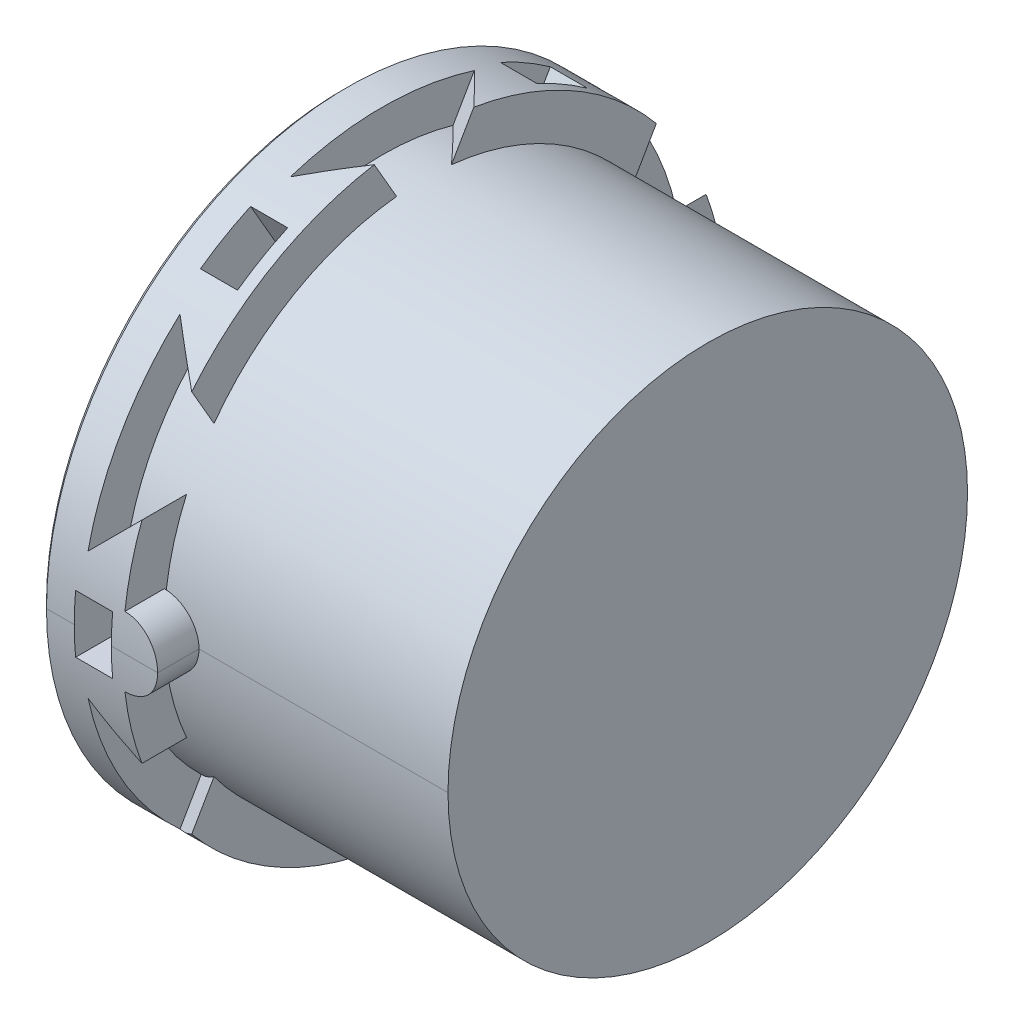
ISO-10303-21;
HEADER;
FILE_DESCRIPTION(('STEP AP214'),'2;1');
FILE_NAME('part.step','',(''),(''),'','','');
FILE_SCHEMA(('AUTOMOTIVE_DESIGN { 1 0 10303 214 1 1 1 1 }'));
ENDSEC;
DATA;
#1=APPLICATION_CONTEXT('core data for automotive mechanical design processes');
#2=APPLICATION_PROTOCOL_DEFINITION('international standard','automotive_design',2000,#1);
#3=PRODUCT_CONTEXT('',#1,'mechanical');
#4=PRODUCT('Part','Part','',(#3));
#5=PRODUCT_RELATED_PRODUCT_CATEGORY('part','',(#4));
#6=PRODUCT_DEFINITION_FORMATION('','',#4);
#7=PRODUCT_DEFINITION_CONTEXT('part definition',#1,'design');
#8=PRODUCT_DEFINITION('design','',#6,#7);
#9=PRODUCT_DEFINITION_SHAPE('','',#8);
#10=(LENGTH_UNIT() NAMED_UNIT(*) SI_UNIT(.MILLI.,.METRE.));
#11=(NAMED_UNIT(*) PLANE_ANGLE_UNIT() SI_UNIT($,.RADIAN.));
#12=(NAMED_UNIT(*) SI_UNIT($,.STERADIAN.) SOLID_ANGLE_UNIT());
#13=UNCERTAINTY_MEASURE_WITH_UNIT(LENGTH_MEASURE(1.E-05),#10,'distance_accuracy_value','');
#14=(GEOMETRIC_REPRESENTATION_CONTEXT(3) GLOBAL_UNCERTAINTY_ASSIGNED_CONTEXT((#13)) GLOBAL_UNIT_ASSIGNED_CONTEXT((#10,
#11,#12)) REPRESENTATION_CONTEXT('',''));
#15=CARTESIAN_POINT('',(0.,0.,0.));
#16=DIRECTION('',(0.,0.,1.));
#17=DIRECTION('',(1.,0.,0.));
#18=AXIS2_PLACEMENT_3D('',#15,#16,#17);
#19=CARTESIAN_POINT('',(38.175,0.,0.));
#20=DIRECTION('',(1.,0.,0.));
#21=DIRECTION('',(0.,0.,1.));
#22=AXIS2_PLACEMENT_3D('',#19,#20,#21);
#23=CYLINDRICAL_SURFACE('',#22,13.);
#24=DIRECTION('',(1.,0.,0.));
#25=VECTOR('',#24,1.);
#26=CARTESIAN_POINT('',(32.9002591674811,0.,13.));
#27=LINE('',#26,#25);
#28=CARTESIAN_POINT('',(30.5,0.,13.));
#29=VERTEX_POINT('',#28);
#30=CARTESIAN_POINT('',(31.7,0.,13.));
#31=VERTEX_POINT('',#30);
#32=EDGE_CURVE('E40',#29,#31,#27,.T.);
#33=ORIENTED_EDGE('',*,*,#32,.F.);
#34=CARTESIAN_POINT('',(30.5,0.,0.));
#35=DIRECTION('',(1.,0.,0.));
#36=DIRECTION('',(0.,0.,1.));
#37=AXIS2_PLACEMENT_3D('',#34,#35,#36);
#38=CIRCLE('',#37,13.);
#39=CARTESIAN_POINT('',(30.5,0.,-13.));
#40=VERTEX_POINT('',#39);
#41=EDGE_CURVE('E11',#29,#40,#38,.T.);
#42=ORIENTED_EDGE('',*,*,#41,.T.);
#43=DIRECTION('',(-1.,0.,0.));
#44=VECTOR('',#43,1.);
#45=CARTESIAN_POINT('',(32.9002591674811,0.,-13.));
#46=LINE('',#45,#44);
#47=CARTESIAN_POINT('',(31.7,0.,-13.));
#48=VERTEX_POINT('',#47);
#49=EDGE_CURVE('E467',#48,#40,#46,.T.);
#50=ORIENTED_EDGE('',*,*,#49,.F.);
#51=CARTESIAN_POINT('',(31.7,0.,0.));
#52=DIRECTION('',(-1.,0.,0.));
#53=DIRECTION('',(0.,0.,1.));
#54=AXIS2_PLACEMENT_3D('',#51,#52,#53);
#55=CIRCLE('',#54,13.);
#56=CARTESIAN_POINT('',(31.7,-1.25,-12.9397642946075));
#57=VERTEX_POINT('',#56);
#58=EDGE_CURVE('E27',#48,#57,#55,.T.);
#59=ORIENTED_EDGE('',*,*,#58,.T.);
#60=DIRECTION('',(1.,0.,0.));
#61=VECTOR('',#60,1.);
#62=CARTESIAN_POINT('',(32.5,-1.25,-12.9397642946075));
#63=LINE('',#62,#61);
#64=CARTESIAN_POINT('',(33.3,-1.25,-12.9397642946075));
#65=VERTEX_POINT('',#64);
#66=EDGE_CURVE('E611',#57,#65,#63,.T.);
#67=ORIENTED_EDGE('',*,*,#66,.T.);
#68=CARTESIAN_POINT('',(33.3,0.,0.));
#69=DIRECTION('',(1.,0.,0.));
#70=DIRECTION('',(0.,0.,1.));
#71=AXIS2_PLACEMENT_3D('',#68,#69,#70);
#72=CIRCLE('',#71,13.);
#73=CARTESIAN_POINT('',(33.3,0.,-13.));
#74=VERTEX_POINT('',#73);
#75=EDGE_CURVE('E607',#65,#74,#72,.T.);
#76=ORIENTED_EDGE('',*,*,#75,.T.);
#77=DIRECTION('',(-1.,0.,0.));
#78=VECTOR('',#77,1.);
#79=CARTESIAN_POINT('',(32.9002591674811,0.,-13.));
#80=LINE('',#79,#78);
#81=CARTESIAN_POINT('',(33.8,0.,-13.));
#82=VERTEX_POINT('',#81);
#83=EDGE_CURVE('E658',#82,#74,#80,.T.);
#84=ORIENTED_EDGE('',*,*,#83,.F.);
#85=CARTESIAN_POINT('',(33.8,0.,0.));
#86=DIRECTION('',(1.,0.,0.));
#87=DIRECTION('',(0.,0.,1.));
#88=AXIS2_PLACEMENT_3D('',#85,#86,#87);
#89=CIRCLE('',#88,13.);
#90=CARTESIAN_POINT('',(33.8,-4.55,-12.1777460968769));
#91=VERTEX_POINT('',#90);
#92=EDGE_CURVE('E459',#91,#82,#89,.T.);
#93=ORIENTED_EDGE('',*,*,#92,.F.);
#94=CARTESIAN_POINT('',(29.25,0.,0.));
#95=DIRECTION('',(-0.707106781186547,-0.707106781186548,0.));
#96=DIRECTION('',(0.707106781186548,-0.707106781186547,0.));
#97=AXIS2_PLACEMENT_3D('',#94,#95,#96);
#98=ELLIPSE('',#97,18.3847763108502,13.);
#99=CARTESIAN_POINT('',(32.,-2.75,-12.7058057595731));
#100=VERTEX_POINT('',#99);
#101=EDGE_CURVE('E573',#100,#91,#98,.T.);
#102=ORIENTED_EDGE('',*,*,#101,.F.);
#103=CARTESIAN_POINT('',(32.,0.,0.));
#104=DIRECTION('',(-1.,0.,0.));
#105=DIRECTION('',(0.,0.,1.));
#106=AXIS2_PLACEMENT_3D('',#103,#104,#105);
#107=CIRCLE('',#106,13.);
#108=CARTESIAN_POINT('',(32.,-9.62855056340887,-8.73447274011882));
#109=VERTEX_POINT('',#108);
#110=EDGE_CURVE('E612',#100,#109,#107,.T.);
#111=ORIENTED_EDGE('',*,*,#110,.T.);
#112=CARTESIAN_POINT('',(29.25,0.,0.));
#113=DIRECTION('',(-0.707106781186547,0.35355339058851,-0.612372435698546));
#114=DIRECTION('',(-0.707106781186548,-0.353553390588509,0.612372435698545));
#115=AXIS2_PLACEMENT_3D('',#112,#113,#114);
#116=ELLIPSE('',#115,18.3847763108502,13.);
#117=CARTESIAN_POINT('',(33.8,-8.2712374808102,-10.0292886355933));
#118=VERTEX_POINT('',#117);
#119=EDGE_CURVE('E477',#118,#109,#116,.T.);
#120=ORIENTED_EDGE('',*,*,#119,.F.);
#121=CARTESIAN_POINT('',(33.8,0.,0.));
#122=DIRECTION('',(1.,0.,0.));
#123=DIRECTION('',(0.,0.,1.));
#124=AXIS2_PLACEMENT_3D('',#121,#122,#123);
#125=CIRCLE('',#124,13.);
#126=CARTESIAN_POINT('',(33.8,-12.8212374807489,-2.14845746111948));
#127=VERTEX_POINT('',#126);
#128=EDGE_CURVE('E730',#127,#118,#125,.T.);
#129=ORIENTED_EDGE('',*,*,#128,.F.);
#130=CARTESIAN_POINT('',(29.25,0.,0.));
#131=DIRECTION('',(-0.707106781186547,-0.35355339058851,0.612372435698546));
#132=DIRECTION('',(0.707106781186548,-0.353553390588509,0.612372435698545));
#133=AXIS2_PLACEMENT_3D('',#130,#131,#132);
#134=ELLIPSE('',#133,18.3847763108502,13.);
#135=CARTESIAN_POINT('',(32.,-12.3785505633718,-3.97133301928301));
#136=VERTEX_POINT('',#135);
#137=EDGE_CURVE('E670',#136,#127,#134,.T.);
#138=ORIENTED_EDGE('',*,*,#137,.F.);
#139=CARTESIAN_POINT('',(32.,0.,0.));
#140=DIRECTION('',(-1.,0.,0.));
#141=DIRECTION('',(0.,0.,1.));
#142=AXIS2_PLACEMENT_3D('',#139,#140,#141);
#143=CIRCLE('',#142,13.);
#144=CARTESIAN_POINT('',(32.,-12.3785505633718,3.97133301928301));
#145=VERTEX_POINT('',#144);
#146=EDGE_CURVE('E926',#136,#145,#143,.T.);
#147=ORIENTED_EDGE('',*,*,#146,.T.);
#148=CARTESIAN_POINT('',(29.25,0.,0.));
#149=DIRECTION('',(-0.707106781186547,-0.35355339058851,-0.612372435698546));
#150=DIRECTION('',(-0.707106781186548,0.353553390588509,0.612372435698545));
#151=AXIS2_PLACEMENT_3D('',#148,#149,#150);
#152=ELLIPSE('',#151,18.3847763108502,13.);
#153=CARTESIAN_POINT('',(33.8,-12.8212374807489,2.14845746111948));
#154=VERTEX_POINT('',#153);
#155=EDGE_CURVE('E500',#154,#145,#152,.T.);
#156=ORIENTED_EDGE('',*,*,#155,.F.);
#157=CARTESIAN_POINT('',(33.8,0.,0.));
#158=DIRECTION('',(1.,0.,0.));
#159=DIRECTION('',(0.,0.,1.));
#160=AXIS2_PLACEMENT_3D('',#157,#158,#159);
#161=CIRCLE('',#160,13.);
#162=CARTESIAN_POINT('',(33.8,-8.2712374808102,10.0292886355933));
#163=VERTEX_POINT('',#162);
#164=EDGE_CURVE('E560',#163,#154,#161,.T.);
#165=ORIENTED_EDGE('',*,*,#164,.F.);
#166=CARTESIAN_POINT('',(29.25,0.,0.));
#167=DIRECTION('',(-0.707106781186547,0.35355339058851,0.612372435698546));
#168=DIRECTION('',(0.707106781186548,0.353553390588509,0.612372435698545));
#169=AXIS2_PLACEMENT_3D('',#166,#167,#168);
#170=ELLIPSE('',#169,18.3847763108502,13.);
#171=CARTESIAN_POINT('',(32.,-9.62855056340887,8.73447274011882));
#172=VERTEX_POINT('',#171);
#173=EDGE_CURVE('E1079',#172,#163,#170,.T.);
#174=ORIENTED_EDGE('',*,*,#173,.F.);
#175=CARTESIAN_POINT('',(32.,0.,0.));
#176=DIRECTION('',(-1.,0.,0.));
#177=DIRECTION('',(0.,0.,1.));
#178=AXIS2_PLACEMENT_3D('',#175,#176,#177);
#179=CIRCLE('',#178,13.);
#180=CARTESIAN_POINT('',(32.,-2.75,12.7058057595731));
#181=VERTEX_POINT('',#180);
#182=EDGE_CURVE('E922',#172,#181,#179,.T.);
#183=ORIENTED_EDGE('',*,*,#182,.T.);
#184=CARTESIAN_POINT('',(29.25,0.,0.));
#185=DIRECTION('',(-0.707106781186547,-0.707106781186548,0.));
#186=DIRECTION('',(0.707106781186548,-0.707106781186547,0.));
#187=AXIS2_PLACEMENT_3D('',#184,#185,#186);
#188=ELLIPSE('',#187,18.3847763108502,13.);
#189=CARTESIAN_POINT('',(33.8,-4.55,12.1777460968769));
#190=VERTEX_POINT('',#189);
#191=EDGE_CURVE('E555',#190,#181,#188,.T.);
#192=ORIENTED_EDGE('',*,*,#191,.F.);
#193=CARTESIAN_POINT('',(33.8,0.,0.));
#194=DIRECTION('',(1.,0.,0.));
#195=DIRECTION('',(0.,0.,1.));
#196=AXIS2_PLACEMENT_3D('',#193,#194,#195);
#197=CIRCLE('',#196,13.);
#198=CARTESIAN_POINT('',(33.8,-1.5,12.913171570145));
#199=VERTEX_POINT('',#198);
#200=EDGE_CURVE('E1095',#199,#190,#197,.T.);
#201=ORIENTED_EDGE('',*,*,#200,.F.);
#202=CARTESIAN_POINT('',(35.3,0.,13.));
#203=CARTESIAN_POINT('',(35.3000004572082,-0.0233854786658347,12.9999999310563));
#204=CARTESIAN_POINT('',(35.2994531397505,-0.0467709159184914,12.9999329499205));
#205=CARTESIAN_POINT('',(35.297250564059,-0.0938242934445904,12.9996686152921));
#206=CARTESIAN_POINT('',(35.2955795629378,-0.117491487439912,12.9994694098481));
#207=CARTESIAN_POINT('',(35.2910856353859,-0.165052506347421,12.9989406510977));
#208=CARTESIAN_POINT('',(35.2882467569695,-0.188944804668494,12.9986092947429));
#209=CARTESIAN_POINT('',(35.281376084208,-0.236895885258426,12.9978161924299));
#210=CARTESIAN_POINT('',(35.2773281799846,-0.260952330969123,12.9973526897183));
#211=CARTESIAN_POINT('',(35.2680009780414,-0.30916718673,12.9962951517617));
#212=CARTESIAN_POINT('',(35.2627054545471,-0.333322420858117,12.9956994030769));
#213=CARTESIAN_POINT('',(35.2508476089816,-0.381666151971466,12.9943777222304));
#214=CARTESIAN_POINT('',(35.2442689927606,-0.405850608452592,12.9936501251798));
#215=CARTESIAN_POINT('',(35.2298131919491,-0.454179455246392,12.9920632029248));
#216=CARTESIAN_POINT('',(35.2219196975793,-0.47831891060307,12.9912022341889));
#217=CARTESIAN_POINT('',(35.2048055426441,-0.526481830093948,12.9893542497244));
#218=CARTESIAN_POINT('',(35.1955686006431,-0.550499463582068,12.9883657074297));
#219=CARTESIAN_POINT('',(35.1789269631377,-0.590656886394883,12.9865817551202));
#220=CARTESIAN_POINT('',(35.171841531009,-0.606931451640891,12.9858214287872));
#221=CARTESIAN_POINT('',(35.156292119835,-0.640983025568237,12.9841568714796));
#222=CARTESIAN_POINT('',(35.1477621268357,-0.658729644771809,12.9832459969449));
#223=CARTESIAN_POINT('',(35.1291360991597,-0.695604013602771,12.9812828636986));
#224=CARTESIAN_POINT('',(35.1189685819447,-0.714695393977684,12.9802255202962));
#225=CARTESIAN_POINT('',(35.0968693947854,-0.754112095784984,12.9779672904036));
#226=CARTESIAN_POINT('',(35.0848612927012,-0.774394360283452,12.976762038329));
#227=CARTESIAN_POINT('',(35.0588764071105,-0.816015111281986,12.9742076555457));
#228=CARTESIAN_POINT('',(35.0448189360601,-0.83730299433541,12.9728548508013));
#229=CARTESIAN_POINT('',(35.0145266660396,-0.88072580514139,12.9700045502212));
#230=CARTESIAN_POINT('',(34.9982075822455,-0.902801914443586,12.9685038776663));
#231=CARTESIAN_POINT('',(34.9723937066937,-0.935789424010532,12.9661846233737));
#232=CARTESIAN_POINT('',(34.9633257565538,-0.947038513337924,12.9653794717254));
#233=CARTESIAN_POINT('',(34.9445587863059,-0.9696432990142,12.9637323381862));
#234=CARTESIAN_POINT('',(34.934848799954,-0.980989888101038,12.9628900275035));
#235=CARTESIAN_POINT('',(34.9147737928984,-1.00375151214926,12.9611692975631));
#236=CARTESIAN_POINT('',(34.9043977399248,-1.01515679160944,12.9602905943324));
#237=CARTESIAN_POINT('',(34.8829673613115,-1.03799545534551,12.9584942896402));
#238=CARTESIAN_POINT('',(34.8719019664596,-1.04941842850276,12.9575763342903));
#239=CARTESIAN_POINT('',(34.8493607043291,-1.07195958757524,12.9557359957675));
#240=CARTESIAN_POINT('',(34.8378831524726,-1.08307608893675,12.9548136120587));
#241=CARTESIAN_POINT('',(34.8149394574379,-1.10459837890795,12.9530088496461));
#242=CARTESIAN_POINT('',(34.8034839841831,-1.11501551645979,12.9521261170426));
#243=CARTESIAN_POINT('',(34.7806269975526,-1.13516311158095,12.9503977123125));
#244=CARTESIAN_POINT('',(34.7692354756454,-1.14490487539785,12.9495517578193));
#245=CARTESIAN_POINT('',(34.7465466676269,-1.16372654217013,12.9478977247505));
#246=CARTESIAN_POINT('',(34.7352587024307,-1.17281767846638,12.9470893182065));
#247=CARTESIAN_POINT('',(34.7021763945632,-1.19867999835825,12.9447617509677));
#248=CARTESIAN_POINT('',(34.6800433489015,-1.21502261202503,12.9432557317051));
#249=CARTESIAN_POINT('',(34.6365370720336,-1.2453341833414,12.9403962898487));
#250=CARTESIAN_POINT('',(34.6152239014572,-1.25938932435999,12.9390396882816));
#251=CARTESIAN_POINT('',(34.5735867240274,-1.2853473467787,12.9364792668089));
#252=CARTESIAN_POINT('',(34.5533143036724,-1.297332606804,12.9352717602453));
#253=CARTESIAN_POINT('',(34.5139541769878,-1.31936896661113,12.9330106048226));
#254=CARTESIAN_POINT('',(34.4949102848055,-1.32949795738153,12.9319525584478));
#255=CARTESIAN_POINT('',(34.4581696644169,-1.34803422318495,12.9299895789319));
#256=CARTESIAN_POINT('',(34.4405098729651,-1.35651418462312,12.9290795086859));
#257=CARTESIAN_POINT('',(34.4066719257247,-1.3719545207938,12.9274182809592));
#258=CARTESIAN_POINT('',(34.3905245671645,-1.37898184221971,12.9266603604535));
#259=CARTESIAN_POINT('',(34.3504792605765,-1.39557690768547,12.9248724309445));
#260=CARTESIAN_POINT('',(34.3264442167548,-1.40481997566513,12.9238783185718));
#261=CARTESIAN_POINT('',(34.2782509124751,-1.42194280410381,12.9220198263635));
#262=CARTESIAN_POINT('',(34.2540985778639,-1.42983911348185,12.9211538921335));
#263=CARTESIAN_POINT('',(34.2057487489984,-1.44429774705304,12.9195578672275));
#264=CARTESIAN_POINT('',(34.1815562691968,-1.45087664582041,12.9188260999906));
#265=CARTESIAN_POINT('',(34.1332015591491,-1.46273303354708,12.9174968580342));
#266=CARTESIAN_POINT('',(34.1090434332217,-1.46802707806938,12.9168976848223));
#267=CARTESIAN_POINT('',(34.060828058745,-1.47735007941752,12.9158340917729));
#268=CARTESIAN_POINT('',(34.036774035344,-1.48139551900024,12.915367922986));
#269=CARTESIAN_POINT('',(33.988833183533,-1.48826079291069,12.9145702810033));
#270=CARTESIAN_POINT('',(33.9649487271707,-1.49109698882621,12.9142370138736));
#271=CARTESIAN_POINT('',(33.9174088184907,-1.49558584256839,12.9137052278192));
#272=CARTESIAN_POINT('',(33.8937549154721,-1.49725469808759,12.9135048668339));
#273=CARTESIAN_POINT('',(33.8467335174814,-1.49945401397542,12.913239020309));
#274=CARTESIAN_POINT('',(33.8233667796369,-1.50000045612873,12.9131716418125));
#275=CARTESIAN_POINT('',(33.8,-1.5,12.913171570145));
#276=B_SPLINE_CURVE_WITH_KNOTS('',3,(#202,#203,#204,#205,#206,#207,#208,#209,#210,#211,#212,
#213,#214,#215,#216,#217,#218,#219,#220,#221,#222,#223,#224,#225,#226,#227,#228,#229,#230,#231,
#232,#233,#234,#235,#236,#237,#238,#239,#240,#241,#242,#243,#244,#245,#246,#247,#248,#249,#250,
#251,#252,#253,#254,#255,#256,#257,#258,#259,#260,#261,#262,#263,#264,#265,#266,#267,#268,#269,
#270,#271,#272,#273,#274,#275),.UNSPECIFIED.,.F.,.F.,(4,2,2,2,2,2,2,2,2,2,2,2,2,2,2,2,2,2,2,2,2,
2,2,2,2,2,2,2,2,2,2,2,2,2,2,2,4),(0.,0.070149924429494,0.141303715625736,0.21346348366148,
0.286631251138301,0.360808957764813,0.435998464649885,0.512201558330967,0.589419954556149,
0.642708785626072,0.701826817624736,0.766774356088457,0.837551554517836,0.914158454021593,
0.996595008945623,1.04000388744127,1.08487060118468,1.13119515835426,1.17897756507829,
1.22698451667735,1.27350368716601,1.31853508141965,1.36207870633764,1.44469489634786,
1.52136171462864,1.59207909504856,1.65684705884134,1.71566574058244,1.76853542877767,
1.84580965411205,1.92205253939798,1.99726581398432,2.07145127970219,2.14461081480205,
2.21674637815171,2.28786001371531,2.35795385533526),.UNSPECIFIED.);
#277=CARTESIAN_POINT('',(35.3,0.,13.));
#278=VERTEX_POINT('',#277);
#279=EDGE_CURVE('E509',#278,#199,#276,.T.);
#280=ORIENTED_EDGE('',*,*,#279,.F.);
#281=DIRECTION('',(1.,0.,0.));
#282=VECTOR('',#281,1.);
#283=CARTESIAN_POINT('',(32.9002591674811,0.,13.));
#284=LINE('',#283,#282);
#285=CARTESIAN_POINT('',(33.3,0.,13.));
#286=VERTEX_POINT('',#285);
#287=EDGE_CURVE('E581',#286,#278,#284,.T.);
#288=ORIENTED_EDGE('',*,*,#287,.F.);
#289=CARTESIAN_POINT('',(33.3,0.,0.));
#290=DIRECTION('',(1.,0.,0.));
#291=DIRECTION('',(0.,0.,1.));
#292=AXIS2_PLACEMENT_3D('',#289,#290,#291);
#293=CIRCLE('',#292,13.);
#294=CARTESIAN_POINT('',(33.3,-1.25,12.9397642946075));
#295=VERTEX_POINT('',#294);
#296=EDGE_CURVE('E498',#286,#295,#293,.T.);
#297=ORIENTED_EDGE('',*,*,#296,.T.);
#298=DIRECTION('',(-1.,0.,0.));
#299=VECTOR('',#298,1.);
#300=CARTESIAN_POINT('',(32.5,-1.25,12.9397642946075));
#301=LINE('',#300,#299);
#302=CARTESIAN_POINT('',(31.7,-1.25,12.9397642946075));
#303=VERTEX_POINT('',#302);
#304=EDGE_CURVE('E494',#295,#303,#301,.T.);
#305=ORIENTED_EDGE('',*,*,#304,.T.);
#306=CARTESIAN_POINT('',(31.7,0.,0.));
#307=DIRECTION('',(-1.,0.,0.));
#308=DIRECTION('',(0.,0.,1.));
#309=AXIS2_PLACEMENT_3D('',#306,#307,#308);
#310=CIRCLE('',#309,13.);
#311=EDGE_CURVE('E499',#303,#31,#310,.T.);
#312=ORIENTED_EDGE('',*,*,#311,.T.);
#313=EDGE_LOOP('',(#33,#42,#50,#59,#67,#76,#84,#93,#102,#111,#120,#129,#138,#147,#156,#165,#174,
#183,#192,#201,#280,#288,#297,#305,#312));
#314=FACE_BOUND('',#313,.T.);
#315=DIRECTION('',(1.,0.,0.));
#316=VECTOR('',#315,1.);
#317=CARTESIAN_POINT('',(32.5,-10.581164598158,7.55241390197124));
#318=LINE('',#317,#316);
#319=CARTESIAN_POINT('',(31.7,-10.581164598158,7.55241390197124));
#320=VERTEX_POINT('',#319);
#321=CARTESIAN_POINT('',(33.3,-10.581164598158,7.55241390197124));
#322=VERTEX_POINT('',#321);
#323=EDGE_CURVE('E809',#320,#322,#318,.T.);
#324=ORIENTED_EDGE('',*,*,#323,.T.);
#325=CARTESIAN_POINT('',(33.3,0.,0.));
#326=DIRECTION('',(1.,0.,0.));
#327=DIRECTION('',(0.,0.,1.));
#328=AXIS2_PLACEMENT_3D('',#325,#326,#327);
#329=CIRCLE('',#328,13.);
#330=CARTESIAN_POINT('',(33.3,-11.8311645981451,5.38735039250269));
#331=VERTEX_POINT('',#330);
#332=EDGE_CURVE('E868',#322,#331,#329,.T.);
#333=ORIENTED_EDGE('',*,*,#332,.T.);
#334=DIRECTION('',(-1.,0.,0.));
#335=VECTOR('',#334,1.);
#336=CARTESIAN_POINT('',(32.5,-11.8311645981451,5.38735039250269));
#337=LINE('',#336,#335);
#338=CARTESIAN_POINT('',(31.7,-11.8311645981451,5.38735039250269));
#339=VERTEX_POINT('',#338);
#340=EDGE_CURVE('E630',#331,#339,#337,.T.);
#341=ORIENTED_EDGE('',*,*,#340,.T.);
#342=CARTESIAN_POINT('',(31.7,0.,0.));
#343=DIRECTION('',(-1.,0.,0.));
#344=DIRECTION('',(0.,0.,1.));
#345=AXIS2_PLACEMENT_3D('',#342,#343,#344);
#346=CIRCLE('',#345,13.);
#347=EDGE_CURVE('E626',#339,#320,#346,.T.);
#348=ORIENTED_EDGE('',*,*,#347,.T.);
#349=EDGE_LOOP('',(#324,#333,#341,#348));
#350=FACE_BOUND('',#349,.T.);
#351=DIRECTION('',(1.,0.,0.));
#352=VECTOR('',#351,1.);
#353=CARTESIAN_POINT('',(32.5,-11.831164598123,-5.38735039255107));
#354=LINE('',#353,#352);
#355=CARTESIAN_POINT('',(31.7,-11.831164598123,-5.38735039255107));
#356=VERTEX_POINT('',#355);
#357=CARTESIAN_POINT('',(33.3,-11.831164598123,-5.38735039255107));
#358=VERTEX_POINT('',#357);
#359=EDGE_CURVE('E631',#356,#358,#354,.T.);
#360=ORIENTED_EDGE('',*,*,#359,.T.);
#361=CARTESIAN_POINT('',(33.3,0.,0.));
#362=DIRECTION('',(1.,0.,0.));
#363=DIRECTION('',(0.,0.,1.));
#364=AXIS2_PLACEMENT_3D('',#361,#362,#363);
#365=CIRCLE('',#364,13.);
#366=CARTESIAN_POINT('',(33.3,-10.5811645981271,-7.5524139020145));
#367=VERTEX_POINT('',#366);
#368=EDGE_CURVE('E616',#358,#367,#365,.T.);
#369=ORIENTED_EDGE('',*,*,#368,.T.);
#370=DIRECTION('',(-1.,0.,0.));
#371=VECTOR('',#370,1.);
#372=CARTESIAN_POINT('',(32.5,-10.5811645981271,-7.55241390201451));
#373=LINE('',#372,#371);
#374=CARTESIAN_POINT('',(31.7,-10.5811645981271,-7.5524139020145));
#375=VERTEX_POINT('',#374);
#376=EDGE_CURVE('E508',#367,#375,#373,.T.);
#377=ORIENTED_EDGE('',*,*,#376,.T.);
#378=CARTESIAN_POINT('',(31.7,0.,0.));
#379=DIRECTION('',(-1.,0.,0.));
#380=DIRECTION('',(0.,0.,1.));
#381=AXIS2_PLACEMENT_3D('',#378,#379,#380);
#382=CIRCLE('',#381,13.);
#383=EDGE_CURVE('E505',#375,#356,#382,.T.);
#384=ORIENTED_EDGE('',*,*,#383,.T.);
#385=EDGE_LOOP('',(#360,#369,#377,#384));
#386=FACE_BOUND('',#385,.T.);
#387=ADVANCED_FACE('F16',(#314,#350,#386),#23,.T.);
#388=CARTESIAN_POINT('',(33.8,0.,12.1075));
#389=DIRECTION('',(0.,0.,-1.));
#390=DIRECTION('',(1.,0.,0.));
#391=AXIS2_PLACEMENT_3D('',#388,#389,#390);
#392=CYLINDRICAL_SURFACE('',#391,1.5);
#393=DIRECTION('',(0.,0.,-1.));
#394=VECTOR('',#393,1.);
#395=CARTESIAN_POINT('',(35.3,0.,12.1075));
#396=LINE('',#395,#394);
#397=CARTESIAN_POINT('',(35.3,0.,11.215));
#398=VERTEX_POINT('',#397);
#399=EDGE_CURVE('E664',#278,#398,#396,.T.);
#400=ORIENTED_EDGE('',*,*,#399,.F.);
#401=ORIENTED_EDGE('',*,*,#279,.T.);
#402=DIRECTION('',(0.,0.,1.));
#403=VECTOR('',#402,1.);
#404=CARTESIAN_POINT('',(33.8,-1.5,12.1075));
#405=LINE('',#404,#403);
#406=CARTESIAN_POINT('',(33.8,-1.5,11.215));
#407=VERTEX_POINT('',#406);
#408=EDGE_CURVE('E836',#407,#199,#405,.T.);
#409=ORIENTED_EDGE('',*,*,#408,.F.);
#410=CARTESIAN_POINT('',(33.8,0.,11.215));
#411=DIRECTION('',(0.,0.,-1.));
#412=DIRECTION('',(1.,0.,0.));
#413=AXIS2_PLACEMENT_3D('',#410,#411,#412);
#414=CIRCLE('',#413,1.5);
#415=EDGE_CURVE('E653',#398,#407,#414,.T.);
#416=ORIENTED_EDGE('',*,*,#415,.F.);
#417=EDGE_LOOP('',(#400,#401,#409,#416));
#418=FACE_BOUND('',#417,.T.);
#419=ADVANCED_FACE('F760',(#418),#392,.T.);
#420=CARTESIAN_POINT('',(30.4,0.,0.));
#421=DIRECTION('',(1.,0.,0.));
#422=DIRECTION('',(0.,0.,1.));
#423=AXIS2_PLACEMENT_3D('',#420,#421,#422);
#424=CONICAL_SURFACE('',#423,12.9,0.785398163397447);
#425=DIRECTION('',(-0.707106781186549,0.,-0.707106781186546));
#426=VECTOR('',#425,1.);
#427=CARTESIAN_POINT('',(30.4,0.,12.9));
#428=LINE('',#427,#426);
#429=CARTESIAN_POINT('',(30.3,0.,12.8));
#430=VERTEX_POINT('',#429);
#431=EDGE_CURVE('E832',#29,#430,#428,.T.);
#432=ORIENTED_EDGE('',*,*,#431,.F.);
#433=CARTESIAN_POINT('',(30.5,0.,0.));
#434=DIRECTION('',(1.,0.,0.));
#435=DIRECTION('',(0.,0.,1.));
#436=AXIS2_PLACEMENT_3D('',#433,#434,#435);
#437=CIRCLE('',#436,13.);
#438=EDGE_CURVE('E472',#40,#29,#437,.T.);
#439=ORIENTED_EDGE('',*,*,#438,.F.);
#440=DIRECTION('',(0.707106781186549,0.,-0.707106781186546));
#441=VECTOR('',#440,1.);
#442=CARTESIAN_POINT('',(30.4,0.,-12.9));
#443=LINE('',#442,#441);
#444=CARTESIAN_POINT('',(30.3,0.,-12.8));
#445=VERTEX_POINT('',#444);
#446=EDGE_CURVE('E577',#445,#40,#443,.T.);
#447=ORIENTED_EDGE('',*,*,#446,.F.);
#448=CARTESIAN_POINT('',(30.3,0.,0.));
#449=DIRECTION('',(-1.,0.,0.));
#450=DIRECTION('',(0.,0.,1.));
#451=AXIS2_PLACEMENT_3D('',#448,#449,#450);
#452=CIRCLE('',#451,12.8);
#453=EDGE_CURVE('E683',#430,#445,#452,.T.);
#454=ORIENTED_EDGE('',*,*,#453,.F.);
#455=EDGE_LOOP('',(#432,#439,#447,#454));
#456=FACE_BOUND('',#455,.T.);
#457=ADVANCED_FACE('F770',(#456),#424,.T.);
#458=CARTESIAN_POINT('',(51.25,0.,0.));
#459=DIRECTION('',(1.,0.,0.));
#460=DIRECTION('',(0.,0.,1.));
#461=AXIS2_PLACEMENT_3D('',#458,#459,#460);
#462=CYLINDRICAL_SURFACE('',#461,11.215);
#463=DIRECTION('',(-1.,0.,0.));
#464=VECTOR('',#463,1.);
#465=CARTESIAN_POINT('',(39.025,0.,11.215));
#466=LINE('',#465,#464);
#467=CARTESIAN_POINT('',(46.05,0.,11.215));
#468=VERTEX_POINT('',#467);
#469=CARTESIAN_POINT('',(35.3,0.,11.215));
#470=VERTEX_POINT('',#469);
#471=EDGE_CURVE('E679',#468,#470,#466,.T.);
#472=ORIENTED_EDGE('',*,*,#471,.F.);
#473=CARTESIAN_POINT('',(46.05,0.,0.));
#474=DIRECTION('',(1.,0.,0.));
#475=DIRECTION('',(0.,0.,1.));
#476=AXIS2_PLACEMENT_3D('',#473,#474,#475);
#477=CIRCLE('',#476,11.215);
#478=CARTESIAN_POINT('',(46.05,0.,-11.215));
#479=VERTEX_POINT('',#478);
#480=EDGE_CURVE('E572',#479,#468,#477,.T.);
#481=ORIENTED_EDGE('',*,*,#480,.F.);
#482=DIRECTION('',(1.,0.,0.));
#483=VECTOR('',#482,1.);
#484=CARTESIAN_POINT('',(39.025,0.,-11.215));
#485=LINE('',#484,#483);
#486=CARTESIAN_POINT('',(33.8,0.,-11.215));
#487=VERTEX_POINT('',#486);
#488=EDGE_CURVE('E956',#487,#479,#485,.T.);
#489=ORIENTED_EDGE('',*,*,#488,.F.);
#490=CARTESIAN_POINT('',(33.8,0.,0.));
#491=DIRECTION('',(1.,0.,0.));
#492=DIRECTION('',(0.,0.,1.));
#493=AXIS2_PLACEMENT_3D('',#490,#491,#492);
#494=CIRCLE('',#493,11.215);
#495=CARTESIAN_POINT('',(33.8,4.55,-10.2505475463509));
#496=VERTEX_POINT('',#495);
#497=EDGE_CURVE('E423',#487,#496,#494,.T.);
#498=ORIENTED_EDGE('',*,*,#497,.T.);
#499=CARTESIAN_POINT('',(29.25,0.,0.));
#500=DIRECTION('',(-0.707106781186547,0.707106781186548,0.));
#501=DIRECTION('',(-0.707106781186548,-0.707106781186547,0.));
#502=AXIS2_PLACEMENT_3D('',#499,#500,#501);
#503=ELLIPSE('',#502,15.8604051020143,11.215);
#504=CARTESIAN_POINT('',(32.,2.75,-10.8726135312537));
#505=VERTEX_POINT('',#504);
#506=EDGE_CURVE('E416',#496,#505,#503,.T.);
#507=ORIENTED_EDGE('',*,*,#506,.T.);
#508=CARTESIAN_POINT('',(32.,0.,0.));
#509=DIRECTION('',(1.,0.,0.));
#510=DIRECTION('',(0.,0.,1.));
#511=AXIS2_PLACEMENT_3D('',#508,#509,#510);
#512=CIRCLE('',#511,11.215);
#513=CARTESIAN_POINT('',(32.,8.04095952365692,-7.81787662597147));
#514=VERTEX_POINT('',#513);
#515=EDGE_CURVE('E405',#505,#514,#512,.T.);
#516=ORIENTED_EDGE('',*,*,#515,.T.);
#517=CARTESIAN_POINT('',(29.25,0.,0.));
#518=DIRECTION('',(-0.707106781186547,-0.35355339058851,-0.612372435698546));
#519=DIRECTION('',(-0.707106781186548,0.353553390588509,0.612372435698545));
#520=AXIS2_PLACEMENT_3D('',#517,#518,#519);
#521=ELLIPSE('',#520,15.8604051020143,11.215);
#522=CARTESIAN_POINT('',(33.8,6.60223457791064,-9.06568936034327));
#523=VERTEX_POINT('',#522);
#524=EDGE_CURVE('E417',#514,#523,#521,.T.);
#525=ORIENTED_EDGE('',*,*,#524,.T.);
#526=CARTESIAN_POINT('',(33.8,0.,0.));
#527=DIRECTION('',(1.,0.,0.));
#528=DIRECTION('',(0.,0.,1.));
#529=AXIS2_PLACEMENT_3D('',#526,#527,#528);
#530=CIRCLE('',#529,11.215);
#531=CARTESIAN_POINT('',(33.8,11.1522345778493,-1.18485818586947));
#532=VERTEX_POINT('',#531);
#533=EDGE_CURVE('E726',#523,#532,#530,.T.);
#534=ORIENTED_EDGE('',*,*,#533,.T.);
#535=CARTESIAN_POINT('',(29.25,0.,0.));
#536=DIRECTION('',(-0.707106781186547,0.35355339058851,0.612372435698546));
#537=DIRECTION('',(0.707106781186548,0.353553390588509,0.612372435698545));
#538=AXIS2_PLACEMENT_3D('',#535,#536,#537);
#539=ELLIPSE('',#538,15.8604051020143,11.215);
#540=CARTESIAN_POINT('',(32.,10.7909595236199,-3.05473690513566));
#541=VERTEX_POINT('',#540);
#542=EDGE_CURVE('E931',#532,#541,#539,.T.);
#543=ORIENTED_EDGE('',*,*,#542,.T.);
#544=CARTESIAN_POINT('',(32.,0.,0.));
#545=DIRECTION('',(1.,0.,0.));
#546=DIRECTION('',(0.,0.,1.));
#547=AXIS2_PLACEMENT_3D('',#544,#545,#546);
#548=CIRCLE('',#547,11.215);
#549=CARTESIAN_POINT('',(32.,10.7909595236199,3.05473690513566));
#550=VERTEX_POINT('',#549);
#551=EDGE_CURVE('E704',#541,#550,#548,.T.);
#552=ORIENTED_EDGE('',*,*,#551,.T.);
#553=CARTESIAN_POINT('',(29.25,0.,0.));
#554=DIRECTION('',(-0.707106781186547,0.35355339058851,-0.612372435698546));
#555=DIRECTION('',(-0.707106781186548,-0.353553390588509,0.612372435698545));
#556=AXIS2_PLACEMENT_3D('',#553,#554,#555);
#557=ELLIPSE('',#556,15.8604051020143,11.215);
#558=CARTESIAN_POINT('',(33.8,11.1522345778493,1.18485818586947));
#559=VERTEX_POINT('',#558);
#560=EDGE_CURVE('E700',#550,#559,#557,.T.);
#561=ORIENTED_EDGE('',*,*,#560,.T.);
#562=CARTESIAN_POINT('',(33.8,0.,0.));
#563=DIRECTION('',(1.,0.,0.));
#564=DIRECTION('',(0.,0.,1.));
#565=AXIS2_PLACEMENT_3D('',#562,#563,#564);
#566=CIRCLE('',#565,11.215);
#567=CARTESIAN_POINT('',(33.8,6.60223457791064,9.06568936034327));
#568=VERTEX_POINT('',#567);
#569=EDGE_CURVE('E705',#559,#568,#566,.T.);
#570=ORIENTED_EDGE('',*,*,#569,.T.);
#571=CARTESIAN_POINT('',(29.25,0.,0.));
#572=DIRECTION('',(-0.707106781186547,-0.35355339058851,0.612372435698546));
#573=DIRECTION('',(0.707106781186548,-0.353553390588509,0.612372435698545));
#574=AXIS2_PLACEMENT_3D('',#571,#572,#573);
#575=ELLIPSE('',#574,15.8604051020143,11.215);
#576=CARTESIAN_POINT('',(32.,8.04095952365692,7.81787662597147));
#577=VERTEX_POINT('',#576);
#578=EDGE_CURVE('E846',#568,#577,#575,.T.);
#579=ORIENTED_EDGE('',*,*,#578,.T.);
#580=CARTESIAN_POINT('',(32.,0.,0.));
#581=DIRECTION('',(1.,0.,0.));
#582=DIRECTION('',(0.,0.,1.));
#583=AXIS2_PLACEMENT_3D('',#580,#581,#582);
#584=CIRCLE('',#583,11.215);
#585=CARTESIAN_POINT('',(32.,2.75,10.8726135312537));
#586=VERTEX_POINT('',#585);
#587=EDGE_CURVE('E967',#577,#586,#584,.T.);
#588=ORIENTED_EDGE('',*,*,#587,.T.);
#589=CARTESIAN_POINT('',(29.25,0.,0.));
#590=DIRECTION('',(-0.707106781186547,0.707106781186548,0.));
#591=DIRECTION('',(-0.707106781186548,-0.707106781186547,0.));
#592=AXIS2_PLACEMENT_3D('',#589,#590,#591);
#593=ELLIPSE('',#592,15.8604051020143,11.215);
#594=CARTESIAN_POINT('',(33.8,4.55,10.2505475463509));
#595=VERTEX_POINT('',#594);
#596=EDGE_CURVE('E963',#586,#595,#593,.T.);
#597=ORIENTED_EDGE('',*,*,#596,.T.);
#598=CARTESIAN_POINT('',(33.8,0.,0.));
#599=DIRECTION('',(1.,0.,0.));
#600=DIRECTION('',(0.,0.,1.));
#601=AXIS2_PLACEMENT_3D('',#598,#599,#600);
#602=CIRCLE('',#601,11.215);
#603=CARTESIAN_POINT('',(33.8,0.,11.215));
#604=VERTEX_POINT('',#603);
#605=EDGE_CURVE('E571',#595,#604,#602,.T.);
#606=ORIENTED_EDGE('',*,*,#605,.T.);
#607=DIRECTION('',(1.,0.,0.));
#608=VECTOR('',#607,1.);
#609=CARTESIAN_POINT('',(33.8,0.,11.215));
#610=LINE('',#609,#608);
#611=EDGE_CURVE('E567',#604,#470,#610,.T.);
#612=ORIENTED_EDGE('',*,*,#611,.T.);
#613=EDGE_LOOP('',(#472,#481,#489,#498,#507,#516,#525,#534,#543,#552,#561,#570,#579,#588,#597,
#606,#612));
#614=FACE_BOUND('',#613,.T.);
#615=ADVANCED_FACE('F420',(#614),#462,.T.);
#616=CARTESIAN_POINT('',(46.05,0.,0.));
#617=DIRECTION('',(1.,0.,0.));
#618=DIRECTION('',(0.,1.,0.));
#619=AXIS2_PLACEMENT_3D('',#616,#617,#618);
#620=PLANE('',#619);
#621=ORIENTED_EDGE('',*,*,#480,.T.);
#622=CARTESIAN_POINT('',(46.05,0.,0.));
#623=DIRECTION('',(1.,0.,0.));
#624=DIRECTION('',(0.,0.,1.));
#625=AXIS2_PLACEMENT_3D('',#622,#623,#624);
#626=CIRCLE('',#625,11.215);
#627=EDGE_CURVE('E680',#468,#479,#626,.T.);
#628=ORIENTED_EDGE('',*,*,#627,.T.);
#629=EDGE_LOOP('',(#621,#628));
#630=FACE_BOUND('',#629,.T.);
#631=ADVANCED_FACE('F1534',(#630),#620,.T.);
#632=CARTESIAN_POINT('',(30.3,0.,0.));
#633=DIRECTION('',(-1.,0.,0.));
#634=DIRECTION('',(0.,0.,1.));
#635=AXIS2_PLACEMENT_3D('',#632,#633,#634);
#636=PLANE('',#635);
#637=ORIENTED_EDGE('',*,*,#453,.T.);
#638=CARTESIAN_POINT('',(30.3,0.,0.));
#639=DIRECTION('',(-1.,0.,0.));
#640=DIRECTION('',(0.,0.,1.));
#641=AXIS2_PLACEMENT_3D('',#638,#639,#640);
#642=CIRCLE('',#641,12.8);
#643=EDGE_CURVE('E685',#445,#430,#642,.T.);
#644=ORIENTED_EDGE('',*,*,#643,.T.);
#645=EDGE_LOOP('',(#637,#644));
#646=FACE_BOUND('',#645,.T.);
#647=ADVANCED_FACE('F1726',(#646),#636,.T.);
#648=CARTESIAN_POINT('',(33.8,0.,11.215));
#649=DIRECTION('',(0.,0.,-1.));
#650=DIRECTION('',(0.,-1.,0.));
#651=AXIS2_PLACEMENT_3D('',#648,#649,#650);
#652=PLANE('',#651);
#653=DIRECTION('',(1.,0.,0.));
#654=VECTOR('',#653,1.);
#655=CARTESIAN_POINT('',(33.8,0.,11.215));
#656=LINE('',#655,#654);
#657=EDGE_CURVE('E648',#604,#398,#656,.T.);
#658=ORIENTED_EDGE('',*,*,#657,.F.);
#659=DIRECTION('',(0.,-1.,0.));
#660=VECTOR('',#659,1.);
#661=CARTESIAN_POINT('',(33.8,0.,11.215));
#662=LINE('',#661,#660);
#663=CARTESIAN_POINT('',(33.8,1.5,11.215));
#664=VERTEX_POINT('',#663);
#665=EDGE_CURVE('E663',#664,#604,#662,.T.);
#666=ORIENTED_EDGE('',*,*,#665,.F.);
#667=CARTESIAN_POINT('',(33.8,0.,11.215));
#668=DIRECTION('',(0.,0.,-1.));
#669=DIRECTION('',(1.,0.,0.));
#670=AXIS2_PLACEMENT_3D('',#667,#668,#669);
#671=CIRCLE('',#670,1.5);
#672=EDGE_CURVE('E652',#664,#398,#671,.T.);
#673=ORIENTED_EDGE('',*,*,#672,.T.);
#674=EDGE_LOOP('',(#658,#666,#673));
#675=FACE_BOUND('',#674,.T.);
#676=ADVANCED_FACE('F1717',(#675),#652,.T.);
#677=CARTESIAN_POINT('',(33.8,0.,11.215));
#678=DIRECTION('',(0.,0.,-1.));
#679=DIRECTION('',(0.,-1.,0.));
#680=AXIS2_PLACEMENT_3D('',#677,#678,#679);
#681=PLANE('',#680);
#682=ORIENTED_EDGE('',*,*,#657,.T.);
#683=ORIENTED_EDGE('',*,*,#415,.T.);
#684=DIRECTION('',(0.,-1.,0.));
#685=VECTOR('',#684,1.);
#686=CARTESIAN_POINT('',(33.8,0.,11.215));
#687=LINE('',#686,#685);
#688=EDGE_CURVE('E1091',#604,#407,#687,.T.);
#689=ORIENTED_EDGE('',*,*,#688,.F.);
#690=EDGE_LOOP('',(#682,#683,#689));
#691=FACE_BOUND('',#690,.T.);
#692=ADVANCED_FACE('F1482',(#691),#681,.T.);
#693=CARTESIAN_POINT('',(51.25,0.,0.));
#694=DIRECTION('',(1.,0.,0.));
#695=DIRECTION('',(0.,0.,1.));
#696=AXIS2_PLACEMENT_3D('',#693,#694,#695);
#697=CYLINDRICAL_SURFACE('',#696,11.215);
#698=ORIENTED_EDGE('',*,*,#471,.T.);
#699=ORIENTED_EDGE('',*,*,#611,.F.);
#700=CARTESIAN_POINT('',(33.8,0.,0.));
#701=DIRECTION('',(1.,0.,0.));
#702=DIRECTION('',(0.,0.,1.));
#703=AXIS2_PLACEMENT_3D('',#700,#701,#702);
#704=CIRCLE('',#703,11.215);
#705=CARTESIAN_POINT('',(33.8,-4.55,10.2505475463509));
#706=VERTEX_POINT('',#705);
#707=EDGE_CURVE('E715',#604,#706,#704,.T.);
#708=ORIENTED_EDGE('',*,*,#707,.T.);
#709=CARTESIAN_POINT('',(29.25,0.,0.));
#710=DIRECTION('',(-0.707106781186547,-0.707106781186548,0.));
#711=DIRECTION('',(0.707106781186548,-0.707106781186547,0.));
#712=AXIS2_PLACEMENT_3D('',#709,#710,#711);
#713=ELLIPSE('',#712,15.8604051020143,11.215);
#714=CARTESIAN_POINT('',(32.,-2.75,10.8726135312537));
#715=VERTEX_POINT('',#714);
#716=EDGE_CURVE('E716',#706,#715,#713,.T.);
#717=ORIENTED_EDGE('',*,*,#716,.T.);
#718=CARTESIAN_POINT('',(32.,0.,0.));
#719=DIRECTION('',(1.,0.,0.));
#720=DIRECTION('',(0.,0.,1.));
#721=AXIS2_PLACEMENT_3D('',#718,#719,#720);
#722=CIRCLE('',#721,11.215);
#723=CARTESIAN_POINT('',(32.,-8.04095952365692,7.81787662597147));
#724=VERTEX_POINT('',#723);
#725=EDGE_CURVE('E645',#715,#724,#722,.T.);
#726=ORIENTED_EDGE('',*,*,#725,.T.);
#727=CARTESIAN_POINT('',(29.25,0.,0.));
#728=DIRECTION('',(-0.707106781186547,0.35355339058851,0.612372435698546));
#729=DIRECTION('',(0.707106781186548,0.353553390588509,0.612372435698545));
#730=AXIS2_PLACEMENT_3D('',#727,#728,#729);
#731=ELLIPSE('',#730,15.8604051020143,11.215);
#732=CARTESIAN_POINT('',(33.8,-6.60223457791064,9.06568936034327));
#733=VERTEX_POINT('',#732);
#734=EDGE_CURVE('E641',#724,#733,#731,.T.);
#735=ORIENTED_EDGE('',*,*,#734,.T.);
#736=CARTESIAN_POINT('',(33.8,0.,0.));
#737=DIRECTION('',(1.,0.,0.));
#738=DIRECTION('',(0.,0.,1.));
#739=AXIS2_PLACEMENT_3D('',#736,#737,#738);
#740=CIRCLE('',#739,11.215);
#741=CARTESIAN_POINT('',(33.8,-11.1522345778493,1.18485818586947));
#742=VERTEX_POINT('',#741);
#743=EDGE_CURVE('E590',#733,#742,#740,.T.);
#744=ORIENTED_EDGE('',*,*,#743,.T.);
#745=CARTESIAN_POINT('',(29.25,0.,0.));
#746=DIRECTION('',(-0.707106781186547,-0.35355339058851,-0.612372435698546));
#747=DIRECTION('',(-0.707106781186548,0.353553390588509,0.612372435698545));
#748=AXIS2_PLACEMENT_3D('',#745,#746,#747);
#749=ELLIPSE('',#748,15.8604051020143,11.215);
#750=CARTESIAN_POINT('',(32.,-10.7909595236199,3.05473690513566));
#751=VERTEX_POINT('',#750);
#752=EDGE_CURVE('E586',#742,#751,#749,.T.);
#753=ORIENTED_EDGE('',*,*,#752,.T.);
#754=CARTESIAN_POINT('',(32.,0.,0.));
#755=DIRECTION('',(1.,0.,0.));
#756=DIRECTION('',(0.,0.,1.));
#757=AXIS2_PLACEMENT_3D('',#754,#755,#756);
#758=CIRCLE('',#757,11.215);
#759=CARTESIAN_POINT('',(32.,-10.7909595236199,-3.05473690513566));
#760=VERTEX_POINT('',#759);
#761=EDGE_CURVE('E591',#751,#760,#758,.T.);
#762=ORIENTED_EDGE('',*,*,#761,.T.);
#763=CARTESIAN_POINT('',(29.25,0.,0.));
#764=DIRECTION('',(-0.707106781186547,-0.35355339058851,0.612372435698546));
#765=DIRECTION('',(0.707106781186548,-0.353553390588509,0.612372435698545));
#766=AXIS2_PLACEMENT_3D('',#763,#764,#765);
#767=ELLIPSE('',#766,15.8604051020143,11.215);
#768=CARTESIAN_POINT('',(33.8,-11.1522345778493,-1.18485818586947));
#769=VERTEX_POINT('',#768);
#770=EDGE_CURVE('E487',#760,#769,#767,.T.);
#771=ORIENTED_EDGE('',*,*,#770,.T.);
#772=CARTESIAN_POINT('',(33.8,0.,0.));
#773=DIRECTION('',(1.,0.,0.));
#774=DIRECTION('',(0.,0.,1.));
#775=AXIS2_PLACEMENT_3D('',#772,#773,#774);
#776=CIRCLE('',#775,11.215);
#777=CARTESIAN_POINT('',(33.8,-6.60223457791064,-9.06568936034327));
#778=VERTEX_POINT('',#777);
#779=EDGE_CURVE('E483',#769,#778,#776,.T.);
#780=ORIENTED_EDGE('',*,*,#779,.T.);
#781=CARTESIAN_POINT('',(29.25,0.,0.));
#782=DIRECTION('',(-0.707106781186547,0.35355339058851,-0.612372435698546));
#783=DIRECTION('',(-0.707106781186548,-0.353553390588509,0.612372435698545));
#784=AXIS2_PLACEMENT_3D('',#781,#782,#783);
#785=ELLIPSE('',#784,15.8604051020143,11.215);
#786=CARTESIAN_POINT('',(32.,-8.04095952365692,-7.81787662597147));
#787=VERTEX_POINT('',#786);
#788=EDGE_CURVE('E488',#778,#787,#785,.T.);
#789=ORIENTED_EDGE('',*,*,#788,.T.);
#790=CARTESIAN_POINT('',(32.,0.,0.));
#791=DIRECTION('',(1.,0.,0.));
#792=DIRECTION('',(0.,0.,1.));
#793=AXIS2_PLACEMENT_3D('',#790,#791,#792);
#794=CIRCLE('',#793,11.215);
#795=CARTESIAN_POINT('',(32.,-2.75,-10.8726135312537));
#796=VERTEX_POINT('',#795);
#797=EDGE_CURVE('E532',#787,#796,#794,.T.);
#798=ORIENTED_EDGE('',*,*,#797,.T.);
#799=CARTESIAN_POINT('',(29.25,0.,0.));
#800=DIRECTION('',(-0.707106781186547,-0.707106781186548,0.));
#801=DIRECTION('',(0.707106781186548,-0.707106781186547,0.));
#802=AXIS2_PLACEMENT_3D('',#799,#800,#801);
#803=ELLIPSE('',#802,15.8604051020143,11.215);
#804=CARTESIAN_POINT('',(33.8,-4.55,-10.2505475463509));
#805=VERTEX_POINT('',#804);
#806=EDGE_CURVE('E528',#796,#805,#803,.T.);
#807=ORIENTED_EDGE('',*,*,#806,.T.);
#808=CARTESIAN_POINT('',(33.8,0.,0.));
#809=DIRECTION('',(1.,0.,0.));
#810=DIRECTION('',(0.,0.,1.));
#811=AXIS2_PLACEMENT_3D('',#808,#809,#810);
#812=CIRCLE('',#811,11.215);
#813=EDGE_CURVE('E533',#805,#487,#812,.T.);
#814=ORIENTED_EDGE('',*,*,#813,.T.);
#815=ORIENTED_EDGE('',*,*,#488,.T.);
#816=ORIENTED_EDGE('',*,*,#627,.F.);
#817=EDGE_LOOP('',(#698,#699,#708,#717,#726,#735,#744,#753,#762,#771,#780,#789,#798,#807,#814,
#815,#816));
#818=FACE_BOUND('',#817,.T.);
#819=ADVANCED_FACE('F1147',(#818),#697,.T.);
#820=CARTESIAN_POINT('',(32.5,7.36121593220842,4.25000000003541));
#821=DIRECTION('',(0.,0.866025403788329,0.499999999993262));
#822=DIRECTION('',(1.,0.,0.));
#823=AXIS2_PLACEMENT_3D('',#820,#821,#822);
#824=PLANE('',#823);
#825=DIRECTION('',(0.,0.499999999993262,-0.866025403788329));
#826=VECTOR('',#825,1.);
#827=CARTESIAN_POINT('',(31.7,7.36121593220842,4.25000000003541));
#828=LINE('',#827,#826);
#829=CARTESIAN_POINT('',(31.7,6.73621593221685,5.33253175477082));
#830=VERTEX_POINT('',#829);
#831=CARTESIAN_POINT('',(31.7,7.9862159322,3.1674682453));
#832=VERTEX_POINT('',#831);
#833=EDGE_CURVE('E510',#830,#832,#828,.T.);
#834=ORIENTED_EDGE('',*,*,#833,.F.);
#835=DIRECTION('',(1.,0.,0.));
#836=VECTOR('',#835,1.);
#837=CARTESIAN_POINT('',(32.5,6.73621593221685,5.33253175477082));
#838=LINE('',#837,#836);
#839=CARTESIAN_POINT('',(33.3,6.73621593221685,5.33253175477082));
#840=VERTEX_POINT('',#839);
#841=EDGE_CURVE('E639',#830,#840,#838,.T.);
#842=ORIENTED_EDGE('',*,*,#841,.T.);
#843=DIRECTION('',(0.,0.499999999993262,-0.866025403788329));
#844=VECTOR('',#843,1.);
#845=CARTESIAN_POINT('',(33.3,7.36121593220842,4.25000000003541));
#846=LINE('',#845,#844);
#847=CARTESIAN_POINT('',(33.3,7.9862159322,3.1674682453));
#848=VERTEX_POINT('',#847);
#849=EDGE_CURVE('E635',#840,#848,#846,.T.);
#850=ORIENTED_EDGE('',*,*,#849,.T.);
#851=DIRECTION('',(-1.,0.,0.));
#852=VECTOR('',#851,1.);
#853=CARTESIAN_POINT('',(32.5,7.9862159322,3.1674682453));
#854=LINE('',#853,#852);
#855=EDGE_CURVE('E640',#848,#832,#854,.T.);
#856=ORIENTED_EDGE('',*,*,#855,.T.);
#857=EDGE_LOOP('',(#834,#842,#850,#856));
#858=FACE_BOUND('',#857,.T.);
#859=ADVANCED_FACE('F1481',(#858),#824,.T.);
#860=CARTESIAN_POINT('',(32.5,0.,8.5));
#861=DIRECTION('',(0.,0.,1.));
#862=DIRECTION('',(1.,0.,0.));
#863=AXIS2_PLACEMENT_3D('',#860,#861,#862);
#864=PLANE('',#863);
#865=DIRECTION('',(0.,1.,0.));
#866=VECTOR('',#865,1.);
#867=CARTESIAN_POINT('',(31.7,0.,8.5));
#868=LINE('',#867,#866);
#869=CARTESIAN_POINT('',(31.7,-1.25,8.5));
#870=VERTEX_POINT('',#869);
#871=CARTESIAN_POINT('',(31.7,1.25,8.5));
#872=VERTEX_POINT('',#871);
#873=EDGE_CURVE('E489',#870,#872,#868,.T.);
#874=ORIENTED_EDGE('',*,*,#873,.F.);
#875=DIRECTION('',(1.,0.,0.));
#876=VECTOR('',#875,1.);
#877=CARTESIAN_POINT('',(32.5,-1.25,8.5));
#878=LINE('',#877,#876);
#879=CARTESIAN_POINT('',(33.3,-1.25,8.5));
#880=VERTEX_POINT('',#879);
#881=EDGE_CURVE('E858',#870,#880,#878,.T.);
#882=ORIENTED_EDGE('',*,*,#881,.T.);
#883=DIRECTION('',(0.,1.,0.));
#884=VECTOR('',#883,1.);
#885=CARTESIAN_POINT('',(33.3,0.,8.5));
#886=LINE('',#885,#884);
#887=CARTESIAN_POINT('',(33.3,1.25,8.5));
#888=VERTEX_POINT('',#887);
#889=EDGE_CURVE('E854',#880,#888,#886,.T.);
#890=ORIENTED_EDGE('',*,*,#889,.T.);
#891=DIRECTION('',(-1.,0.,0.));
#892=VECTOR('',#891,1.);
#893=CARTESIAN_POINT('',(32.5,1.25,8.5));
#894=LINE('',#893,#892);
#895=EDGE_CURVE('E859',#888,#872,#894,.T.);
#896=ORIENTED_EDGE('',*,*,#895,.T.);
#897=EDGE_LOOP('',(#874,#882,#890,#896));
#898=FACE_BOUND('',#897,.T.);
#899=ADVANCED_FACE('F1608',(#898),#864,.T.);
#900=CARTESIAN_POINT('',(32.5,-7.36121593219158,4.24999999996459));
#901=DIRECTION('',(0.,-0.866025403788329,0.499999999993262));
#902=DIRECTION('',(-1.,0.,0.));
#903=AXIS2_PLACEMENT_3D('',#900,#901,#902);
#904=PLANE('',#903);
#905=DIRECTION('',(0.,0.499999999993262,0.866025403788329));
#906=VECTOR('',#905,1.);
#907=CARTESIAN_POINT('',(31.7,-7.36121593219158,4.24999999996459));
#908=LINE('',#907,#906);
#909=CARTESIAN_POINT('',(31.7,-7.98621593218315,3.16746824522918));
#910=VERTEX_POINT('',#909);
#911=CARTESIAN_POINT('',(31.7,-6.7362159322,5.3325317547));
#912=VERTEX_POINT('',#911);
#913=EDGE_CURVE('E592',#910,#912,#908,.T.);
#914=ORIENTED_EDGE('',*,*,#913,.F.);
#915=DIRECTION('',(1.,0.,0.));
#916=VECTOR('',#915,1.);
#917=CARTESIAN_POINT('',(32.5,-7.98621593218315,3.16746824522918));
#918=LINE('',#917,#916);
#919=CARTESIAN_POINT('',(33.3,-7.98621593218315,3.16746824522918));
#920=VERTEX_POINT('',#919);
#921=EDGE_CURVE('E537',#910,#920,#918,.T.);
#922=ORIENTED_EDGE('',*,*,#921,.T.);
#923=DIRECTION('',(0.,0.499999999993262,0.866025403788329));
#924=VECTOR('',#923,1.);
#925=CARTESIAN_POINT('',(33.3,-7.36121593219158,4.24999999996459));
#926=LINE('',#925,#924);
#927=CARTESIAN_POINT('',(33.3,-6.7362159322,5.3325317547));
#928=VERTEX_POINT('',#927);
#929=EDGE_CURVE('E534',#920,#928,#926,.T.);
#930=ORIENTED_EDGE('',*,*,#929,.T.);
#931=DIRECTION('',(-1.,0.,0.));
#932=VECTOR('',#931,1.);
#933=CARTESIAN_POINT('',(32.5,-6.7362159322,5.3325317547));
#934=LINE('',#933,#932);
#935=EDGE_CURVE('E538',#928,#912,#934,.T.);
#936=ORIENTED_EDGE('',*,*,#935,.T.);
#937=EDGE_LOOP('',(#914,#922,#930,#936));
#938=FACE_BOUND('',#937,.T.);
#939=ADVANCED_FACE('F1183',(#938),#904,.T.);
#940=CARTESIAN_POINT('',(32.5,-7.36121593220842,-4.25000000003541));
#941=DIRECTION('',(0.,-0.866025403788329,-0.499999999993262));
#942=DIRECTION('',(0.,0.499999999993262,-0.866025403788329));
#943=AXIS2_PLACEMENT_3D('',#940,#941,#942);
#944=PLANE('',#943);
#945=DIRECTION('',(0.,-0.499999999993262,0.866025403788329));
#946=VECTOR('',#945,1.);
#947=CARTESIAN_POINT('',(31.7,-7.36121593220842,-4.25000000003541));
#948=LINE('',#947,#946);
#949=CARTESIAN_POINT('',(31.7,-6.73621593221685,-5.33253175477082));
#950=VERTEX_POINT('',#949);
#951=CARTESIAN_POINT('',(31.7,-7.9862159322,-3.1674682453));
#952=VERTEX_POINT('',#951);
#953=EDGE_CURVE('E523',#950,#952,#948,.T.);
#954=ORIENTED_EDGE('',*,*,#953,.F.);
#955=DIRECTION('',(1.,0.,0.));
#956=VECTOR('',#955,1.);
#957=CARTESIAN_POINT('',(32.5,-6.73621593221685,-5.33253175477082));
#958=LINE('',#957,#956);
#959=CARTESIAN_POINT('',(33.3,-6.73621593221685,-5.33253175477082));
#960=VERTEX_POINT('',#959);
#961=EDGE_CURVE('E585',#950,#960,#958,.T.);
#962=ORIENTED_EDGE('',*,*,#961,.T.);
#963=DIRECTION('',(0.,-0.499999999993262,0.866025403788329));
#964=VECTOR('',#963,1.);
#965=CARTESIAN_POINT('',(33.3,-7.36121593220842,-4.25000000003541));
#966=LINE('',#965,#964);
#967=CARTESIAN_POINT('',(33.3,-7.9862159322,-3.1674682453));
#968=VERTEX_POINT('',#967);
#969=EDGE_CURVE('E671',#960,#968,#966,.T.);
#970=ORIENTED_EDGE('',*,*,#969,.T.);
#971=DIRECTION('',(-1.,0.,0.));
#972=VECTOR('',#971,1.);
#973=CARTESIAN_POINT('',(32.5,-7.9862159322,-3.1674682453));
#974=LINE('',#973,#972);
#975=EDGE_CURVE('E675',#968,#952,#974,.T.);
#976=ORIENTED_EDGE('',*,*,#975,.T.);
#977=EDGE_LOOP('',(#954,#962,#970,#976));
#978=FACE_BOUND('',#977,.T.);
#979=ADVANCED_FACE('F781',(#978),#944,.T.);
#980=CARTESIAN_POINT('',(32.5,0.,-8.5));
#981=DIRECTION('',(0.,0.,-1.));
#982=DIRECTION('',(0.,-1.,0.));
#983=AXIS2_PLACEMENT_3D('',#980,#981,#982);
#984=PLANE('',#983);
#985=DIRECTION('',(0.,-1.,0.));
#986=VECTOR('',#985,1.);
#987=CARTESIAN_POINT('',(31.7,0.,-8.5));
#988=LINE('',#987,#986);
#989=CARTESIAN_POINT('',(31.7,1.25,-8.5));
#990=VERTEX_POINT('',#989);
#991=CARTESIAN_POINT('',(31.7,-1.25,-8.5));
#992=VERTEX_POINT('',#991);
#993=EDGE_CURVE('E869',#990,#992,#988,.T.);
#994=ORIENTED_EDGE('',*,*,#993,.F.);
#995=DIRECTION('',(1.,0.,0.));
#996=VECTOR('',#995,1.);
#997=CARTESIAN_POINT('',(32.5,1.25,-8.5));
#998=LINE('',#997,#996);
#999=CARTESIAN_POINT('',(33.3,1.25,-8.5));
#1000=VERTEX_POINT('',#999);
#1001=EDGE_CURVE('E902',#990,#1000,#998,.T.);
#1002=ORIENTED_EDGE('',*,*,#1001,.T.);
#1003=DIRECTION('',(0.,-1.,0.));
#1004=VECTOR('',#1003,1.);
#1005=CARTESIAN_POINT('',(33.3,0.,-8.5));
#1006=LINE('',#1005,#1004);
#1007=CARTESIAN_POINT('',(33.3,-1.25,-8.5));
#1008=VERTEX_POINT('',#1007);
#1009=EDGE_CURVE('E906',#1000,#1008,#1006,.T.);
#1010=ORIENTED_EDGE('',*,*,#1009,.T.);
#1011=DIRECTION('',(-1.,0.,0.));
#1012=VECTOR('',#1011,1.);
#1013=CARTESIAN_POINT('',(32.5,-1.25,-8.5));
#1014=LINE('',#1013,#1012);
#1015=EDGE_CURVE('E996',#1008,#992,#1014,.T.);
#1016=ORIENTED_EDGE('',*,*,#1015,.T.);
#1017=EDGE_LOOP('',(#994,#1002,#1010,#1016));
#1018=FACE_BOUND('',#1017,.T.);
#1019=ADVANCED_FACE('F778',(#1018),#984,.T.);
#1020=CARTESIAN_POINT('',(30.4,0.,0.));
#1021=DIRECTION('',(1.,0.,0.));
#1022=DIRECTION('',(0.,0.,1.));
#1023=AXIS2_PLACEMENT_3D('',#1020,#1021,#1022);
#1024=CONICAL_SURFACE('',#1023,12.9,0.785398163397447);
#1025=ORIENTED_EDGE('',*,*,#431,.T.);
#1026=ORIENTED_EDGE('',*,*,#643,.F.);
#1027=ORIENTED_EDGE('',*,*,#446,.T.);
#1028=ORIENTED_EDGE('',*,*,#41,.F.);
#1029=EDGE_LOOP('',(#1025,#1026,#1027,#1028));
#1030=FACE_BOUND('',#1029,.T.);
#1031=ADVANCED_FACE('F780',(#1030),#1024,.T.);
#1032=CARTESIAN_POINT('',(32.9,-3.65,0.));
#1033=DIRECTION('',(-0.707106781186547,-0.707106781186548,0.));
#1034=DIRECTION('',(-0.707106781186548,0.707106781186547,0.));
#1035=AXIS2_PLACEMENT_3D('',#1032,#1033,#1034);
#1036=PLANE('',#1035);
#1037=ORIENTED_EDGE('',*,*,#101,.T.);
#1038=DIRECTION('',(0.,0.,-1.));
#1039=VECTOR('',#1038,1.);
#1040=CARTESIAN_POINT('',(33.8,-4.55,0.));
#1041=LINE('',#1040,#1039);
#1042=EDGE_CURVE('E460',#805,#91,#1041,.T.);
#1043=ORIENTED_EDGE('',*,*,#1042,.F.);
#1044=ORIENTED_EDGE('',*,*,#806,.F.);
#1045=DIRECTION('',(0.,0.,1.));
#1046=VECTOR('',#1045,1.);
#1047=CARTESIAN_POINT('',(32.,-2.75,6.05375));
#1048=LINE('',#1047,#1046);
#1049=EDGE_CURVE('E449',#100,#796,#1048,.T.);
#1050=ORIENTED_EDGE('',*,*,#1049,.F.);
#1051=EDGE_LOOP('',(#1037,#1043,#1044,#1050));
#1052=FACE_BOUND('',#1051,.T.);
#1053=ADVANCED_FACE('F1525',(#1052),#1036,.T.);
#1054=CARTESIAN_POINT('',(33.8,0.,0.));
#1055=DIRECTION('',(1.,0.,0.));
#1056=DIRECTION('',(0.,1.,0.));
#1057=AXIS2_PLACEMENT_3D('',#1054,#1055,#1056);
#1058=PLANE('',#1057);
#1059=ORIENTED_EDGE('',*,*,#92,.T.);
#1060=CARTESIAN_POINT('',(33.8,0.,0.));
#1061=DIRECTION('',(1.,0.,0.));
#1062=DIRECTION('',(0.,0.,1.));
#1063=AXIS2_PLACEMENT_3D('',#1060,#1061,#1062);
#1064=CIRCLE('',#1063,13.);
#1065=CARTESIAN_POINT('',(33.8,4.55,-12.1777460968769));
#1066=VERTEX_POINT('',#1065);
#1067=EDGE_CURVE('E455',#82,#1066,#1064,.T.);
#1068=ORIENTED_EDGE('',*,*,#1067,.T.);
#1069=DIRECTION('',(0.,0.,-1.));
#1070=VECTOR('',#1069,1.);
#1071=CARTESIAN_POINT('',(33.8,4.55,0.));
#1072=LINE('',#1071,#1070);
#1073=EDGE_CURVE('E440',#496,#1066,#1072,.T.);
#1074=ORIENTED_EDGE('',*,*,#1073,.F.);
#1075=ORIENTED_EDGE('',*,*,#497,.F.);
#1076=ORIENTED_EDGE('',*,*,#813,.F.);
#1077=ORIENTED_EDGE('',*,*,#1042,.T.);
#1078=EDGE_LOOP('',(#1059,#1068,#1074,#1075,#1076,#1077));
#1079=FACE_BOUND('',#1078,.T.);
#1080=ADVANCED_FACE('F1521',(#1079),#1058,.T.);
#1081=CARTESIAN_POINT('',(32.9,3.65,0.));
#1082=DIRECTION('',(-0.707106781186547,0.707106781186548,0.));
#1083=DIRECTION('',(0.,0.,1.));
#1084=AXIS2_PLACEMENT_3D('',#1081,#1082,#1083);
#1085=PLANE('',#1084);
#1086=CARTESIAN_POINT('',(29.25,0.,0.));
#1087=DIRECTION('',(-0.707106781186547,0.707106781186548,0.));
#1088=DIRECTION('',(-0.707106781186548,-0.707106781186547,0.));
#1089=AXIS2_PLACEMENT_3D('',#1086,#1087,#1088);
#1090=ELLIPSE('',#1089,18.3847763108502,13.);
#1091=CARTESIAN_POINT('',(32.,2.75,-12.7058057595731));
#1092=VERTEX_POINT('',#1091);
#1093=EDGE_CURVE('E430',#1066,#1092,#1090,.T.);
#1094=ORIENTED_EDGE('',*,*,#1093,.T.);
#1095=DIRECTION('',(0.,0.,-1.));
#1096=VECTOR('',#1095,1.);
#1097=CARTESIAN_POINT('',(32.,2.75,6.05375));
#1098=LINE('',#1097,#1096);
#1099=EDGE_CURVE('E409',#505,#1092,#1098,.T.);
#1100=ORIENTED_EDGE('',*,*,#1099,.F.);
#1101=ORIENTED_EDGE('',*,*,#506,.F.);
#1102=ORIENTED_EDGE('',*,*,#1073,.T.);
#1103=EDGE_LOOP('',(#1094,#1100,#1101,#1102));
#1104=FACE_BOUND('',#1103,.T.);
#1105=ADVANCED_FACE('F428',(#1104),#1085,.T.);
#1106=CARTESIAN_POINT('',(32.,0.,12.1075));
#1107=DIRECTION('',(-1.,0.,0.));
#1108=DIRECTION('',(0.,0.,1.));
#1109=AXIS2_PLACEMENT_3D('',#1106,#1107,#1108);
#1110=PLANE('',#1109);
#1111=DIRECTION('',(0.,-0.866025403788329,0.499999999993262));
#1112=VECTOR('',#1111,1.);
#1113=CARTESIAN_POINT('',(32.,-3.99635064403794,-0.868132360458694));
#1114=LINE('',#1113,#1112);
#1115=CARTESIAN_POINT('',(32.,9.62855056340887,-8.73447274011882));
#1116=VERTEX_POINT('',#1115);
#1117=EDGE_CURVE('E412',#1116,#514,#1114,.T.);
#1118=ORIENTED_EDGE('',*,*,#1117,.T.);
#1119=ORIENTED_EDGE('',*,*,#515,.F.);
#1120=ORIENTED_EDGE('',*,*,#1099,.T.);
#1121=CARTESIAN_POINT('',(32.,0.,0.));
#1122=DIRECTION('',(-1.,0.,0.));
#1123=DIRECTION('',(0.,0.,1.));
#1124=AXIS2_PLACEMENT_3D('',#1121,#1122,#1123);
#1125=CIRCLE('',#1124,13.);
#1126=EDGE_CURVE('E654',#1116,#1092,#1125,.T.);
#1127=ORIENTED_EDGE('',*,*,#1126,.F.);
#1128=EDGE_LOOP('',(#1118,#1119,#1120,#1127));
#1129=FACE_BOUND('',#1128,.T.);
#1130=ADVANCED_FACE('F407',(#1129),#1110,.F.);
#1131=CARTESIAN_POINT('',(32.9,-1.82499999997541,-3.1609927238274));
#1132=DIRECTION('',(-0.707106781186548,-0.353553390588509,-0.612372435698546));
#1133=DIRECTION('',(-0.654653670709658,0.,0.755928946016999));
#1134=AXIS2_PLACEMENT_3D('',#1131,#1132,#1133);
#1135=PLANE('',#1134);
#1136=CARTESIAN_POINT('',(29.25,0.,0.));
#1137=DIRECTION('',(-0.707106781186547,-0.35355339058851,-0.612372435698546));
#1138=DIRECTION('',(-0.707106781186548,0.353553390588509,0.612372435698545));
#1139=AXIS2_PLACEMENT_3D('',#1136,#1137,#1138);
#1140=ELLIPSE('',#1139,18.3847763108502,13.);
#1141=CARTESIAN_POINT('',(33.8,8.2712374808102,-10.0292886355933));
#1142=VERTEX_POINT('',#1141);
#1143=EDGE_CURVE('E433',#1116,#1142,#1140,.T.);
#1144=ORIENTED_EDGE('',*,*,#1143,.T.);
#1145=DIRECTION('',(0.,0.866025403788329,-0.499999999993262));
#1146=VECTOR('',#1145,1.);
#1147=CARTESIAN_POINT('',(33.8,-2.27499999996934,-3.9404155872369));
#1148=LINE('',#1147,#1146);
#1149=EDGE_CURVE('E621',#523,#1142,#1148,.T.);
#1150=ORIENTED_EDGE('',*,*,#1149,.F.);
#1151=ORIENTED_EDGE('',*,*,#524,.F.);
#1152=ORIENTED_EDGE('',*,*,#1117,.F.);
#1153=EDGE_LOOP('',(#1144,#1150,#1151,#1152));
#1154=FACE_BOUND('',#1153,.T.);
#1155=ADVANCED_FACE('F1443',(#1154),#1135,.T.);
#1156=CARTESIAN_POINT('',(33.8,0.,0.));
#1157=DIRECTION('',(1.,0.,0.));
#1158=DIRECTION('',(0.,1.,0.));
#1159=AXIS2_PLACEMENT_3D('',#1156,#1157,#1158);
#1160=PLANE('',#1159);
#1161=CARTESIAN_POINT('',(33.8,0.,0.));
#1162=DIRECTION('',(1.,0.,0.));
#1163=DIRECTION('',(0.,0.,1.));
#1164=AXIS2_PLACEMENT_3D('',#1161,#1162,#1163);
#1165=CIRCLE('',#1164,13.);
#1166=CARTESIAN_POINT('',(33.8,12.8212374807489,-2.14845746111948));
#1167=VERTEX_POINT('',#1166);
#1168=EDGE_CURVE('E443',#1142,#1167,#1165,.T.);
#1169=ORIENTED_EDGE('',*,*,#1168,.T.);
#1170=DIRECTION('',(0.,0.866025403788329,-0.499999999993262));
#1171=VECTOR('',#1170,1.);
#1172=CARTESIAN_POINT('',(33.8,2.27499999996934,3.9404155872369));
#1173=LINE('',#1172,#1171);
#1174=EDGE_CURVE('E622',#532,#1167,#1173,.T.);
#1175=ORIENTED_EDGE('',*,*,#1174,.F.);
#1176=ORIENTED_EDGE('',*,*,#533,.F.);
#1177=ORIENTED_EDGE('',*,*,#1149,.T.);
#1178=EDGE_LOOP('',(#1169,#1175,#1176,#1177));
#1179=FACE_BOUND('',#1178,.T.);
#1180=ADVANCED_FACE('F1559',(#1179),#1160,.T.);
#1181=CARTESIAN_POINT('',(32.9,1.82499999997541,3.1609927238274));
#1182=DIRECTION('',(-0.707106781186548,0.353553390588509,0.612372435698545));
#1183=DIRECTION('',(0.447213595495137,0.894427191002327,0.));
#1184=AXIS2_PLACEMENT_3D('',#1181,#1182,#1183);
#1185=PLANE('',#1184);
#1186=CARTESIAN_POINT('',(29.25,0.,0.));
#1187=DIRECTION('',(-0.707106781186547,0.35355339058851,0.612372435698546));
#1188=DIRECTION('',(0.707106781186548,0.353553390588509,0.612372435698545));
#1189=AXIS2_PLACEMENT_3D('',#1186,#1187,#1188);
#1190=ELLIPSE('',#1189,18.3847763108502,13.);
#1191=CARTESIAN_POINT('',(32.,12.3785505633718,-3.97133301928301));
#1192=VERTEX_POINT('',#1191);
#1193=EDGE_CURVE('E617',#1167,#1192,#1190,.T.);
#1194=ORIENTED_EDGE('',*,*,#1193,.T.);
#1195=DIRECTION('',(0.,0.866025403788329,-0.499999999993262));
#1196=VECTOR('',#1195,1.);
#1197=CARTESIAN_POINT('',(32.,-1.246350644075,3.89500736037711));
#1198=LINE('',#1197,#1196);
#1199=EDGE_CURVE('E540',#541,#1192,#1198,.T.);
#1200=ORIENTED_EDGE('',*,*,#1199,.F.);
#1201=ORIENTED_EDGE('',*,*,#542,.F.);
#1202=ORIENTED_EDGE('',*,*,#1174,.T.);
#1203=EDGE_LOOP('',(#1194,#1200,#1201,#1202));
#1204=FACE_BOUND('',#1203,.T.);
#1205=ADVANCED_FACE('F1472',(#1204),#1185,.T.);
#1206=CARTESIAN_POINT('',(32.,0.,12.1075));
#1207=DIRECTION('',(-1.,0.,0.));
#1208=DIRECTION('',(0.,0.,1.));
#1209=AXIS2_PLACEMENT_3D('',#1206,#1207,#1208);
#1210=PLANE('',#1209);
#1211=DIRECTION('',(0.,-0.866025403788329,-0.499999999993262));
#1212=VECTOR('',#1211,1.);
#1213=CARTESIAN_POINT('',(32.,3.99635064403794,-0.868132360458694));
#1214=LINE('',#1213,#1212);
#1215=CARTESIAN_POINT('',(32.,12.3785505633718,3.97133301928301));
#1216=VERTEX_POINT('',#1215);
#1217=EDGE_CURVE('E447',#1216,#550,#1214,.T.);
#1218=ORIENTED_EDGE('',*,*,#1217,.T.);
#1219=ORIENTED_EDGE('',*,*,#551,.F.);
#1220=ORIENTED_EDGE('',*,*,#1199,.T.);
#1221=CARTESIAN_POINT('',(32.,0.,0.));
#1222=DIRECTION('',(-1.,0.,0.));
#1223=DIRECTION('',(0.,0.,1.));
#1224=AXIS2_PLACEMENT_3D('',#1221,#1222,#1223);
#1225=CIRCLE('',#1224,13.);
#1226=EDGE_CURVE('E657',#1216,#1192,#1225,.T.);
#1227=ORIENTED_EDGE('',*,*,#1226,.F.);
#1228=EDGE_LOOP('',(#1218,#1219,#1220,#1227));
#1229=FACE_BOUND('',#1228,.T.);
#1230=ADVANCED_FACE('F1468',(#1229),#1210,.F.);
#1231=CARTESIAN_POINT('',(32.9,1.82499999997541,-3.1609927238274));
#1232=DIRECTION('',(-0.707106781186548,0.353553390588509,-0.612372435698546));
#1233=DIRECTION('',(-0.654653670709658,0.,0.755928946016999));
#1234=AXIS2_PLACEMENT_3D('',#1231,#1232,#1233);
#1235=PLANE('',#1234);
#1236=CARTESIAN_POINT('',(29.25,0.,0.));
#1237=DIRECTION('',(-0.707106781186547,0.35355339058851,-0.612372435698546));
#1238=DIRECTION('',(-0.707106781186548,-0.353553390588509,0.612372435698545));
#1239=AXIS2_PLACEMENT_3D('',#1236,#1237,#1238);
#1240=ELLIPSE('',#1239,18.3847763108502,13.);
#1241=CARTESIAN_POINT('',(33.8,12.8212374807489,2.14845746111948));
#1242=VERTEX_POINT('',#1241);
#1243=EDGE_CURVE('E543',#1216,#1242,#1240,.T.);
#1244=ORIENTED_EDGE('',*,*,#1243,.T.);
#1245=DIRECTION('',(0.,0.866025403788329,0.499999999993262));
#1246=VECTOR('',#1245,1.);
#1247=CARTESIAN_POINT('',(33.8,2.27499999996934,-3.9404155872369));
#1248=LINE('',#1247,#1246);
#1249=EDGE_CURVE('E478',#559,#1242,#1248,.T.);
#1250=ORIENTED_EDGE('',*,*,#1249,.F.);
#1251=ORIENTED_EDGE('',*,*,#560,.F.);
#1252=ORIENTED_EDGE('',*,*,#1217,.F.);
#1253=EDGE_LOOP('',(#1244,#1250,#1251,#1252));
#1254=FACE_BOUND('',#1253,.T.);
#1255=ADVANCED_FACE('F1386',(#1254),#1235,.T.);
#1256=CARTESIAN_POINT('',(33.8,0.,0.));
#1257=DIRECTION('',(1.,0.,0.));
#1258=DIRECTION('',(0.,1.,0.));
#1259=AXIS2_PLACEMENT_3D('',#1256,#1257,#1258);
#1260=PLANE('',#1259);
#1261=CARTESIAN_POINT('',(33.8,0.,0.));
#1262=DIRECTION('',(1.,0.,0.));
#1263=DIRECTION('',(0.,0.,1.));
#1264=AXIS2_PLACEMENT_3D('',#1261,#1262,#1263);
#1265=CIRCLE('',#1264,13.);
#1266=CARTESIAN_POINT('',(33.8,8.2712374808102,10.0292886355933));
#1267=VERTEX_POINT('',#1266);
#1268=EDGE_CURVE('E481',#1242,#1267,#1265,.T.);
#1269=ORIENTED_EDGE('',*,*,#1268,.T.);
#1270=DIRECTION('',(0.,0.866025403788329,0.499999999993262));
#1271=VECTOR('',#1270,1.);
#1272=CARTESIAN_POINT('',(33.8,-2.27499999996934,3.9404155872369));
#1273=LINE('',#1272,#1271);
#1274=EDGE_CURVE('E544',#568,#1267,#1273,.T.);
#1275=ORIENTED_EDGE('',*,*,#1274,.F.);
#1276=ORIENTED_EDGE('',*,*,#569,.F.);
#1277=ORIENTED_EDGE('',*,*,#1249,.T.);
#1278=EDGE_LOOP('',(#1269,#1275,#1276,#1277));
#1279=FACE_BOUND('',#1278,.T.);
#1280=ADVANCED_FACE('F1381',(#1279),#1260,.T.);
#1281=CARTESIAN_POINT('',(32.9,-1.82499999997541,3.1609927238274));
#1282=DIRECTION('',(-0.707106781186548,-0.353553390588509,0.612372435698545));
#1283=DIRECTION('',(-0.447213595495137,0.894427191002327,0.));
#1284=AXIS2_PLACEMENT_3D('',#1281,#1282,#1283);
#1285=PLANE('',#1284);
#1286=CARTESIAN_POINT('',(29.25,0.,0.));
#1287=DIRECTION('',(-0.707106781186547,-0.35355339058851,0.612372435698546));
#1288=DIRECTION('',(0.707106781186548,-0.353553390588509,0.612372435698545));
#1289=AXIS2_PLACEMENT_3D('',#1286,#1287,#1288);
#1290=ELLIPSE('',#1289,18.3847763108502,13.);
#1291=CARTESIAN_POINT('',(32.,9.62855056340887,8.73447274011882));
#1292=VERTEX_POINT('',#1291);
#1293=EDGE_CURVE('E482',#1267,#1292,#1290,.T.);
#1294=ORIENTED_EDGE('',*,*,#1293,.T.);
#1295=DIRECTION('',(0.,0.866025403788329,0.499999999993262));
#1296=VECTOR('',#1295,1.);
#1297=CARTESIAN_POINT('',(32.,1.246350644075,3.89500736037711));
#1298=LINE('',#1297,#1296);
#1299=EDGE_CURVE('E1037',#577,#1292,#1298,.T.);
#1300=ORIENTED_EDGE('',*,*,#1299,.F.);
#1301=ORIENTED_EDGE('',*,*,#578,.F.);
#1302=ORIENTED_EDGE('',*,*,#1274,.T.);
#1303=EDGE_LOOP('',(#1294,#1300,#1301,#1302));
#1304=FACE_BOUND('',#1303,.T.);
#1305=ADVANCED_FACE('F1385',(#1304),#1285,.T.);
#1306=CARTESIAN_POINT('',(32.,0.,12.1075));
#1307=DIRECTION('',(-1.,0.,0.));
#1308=DIRECTION('',(0.,0.,1.));
#1309=AXIS2_PLACEMENT_3D('',#1306,#1307,#1308);
#1310=PLANE('',#1309);
#1311=DIRECTION('',(0.,0.,-1.));
#1312=VECTOR('',#1311,1.);
#1313=CARTESIAN_POINT('',(32.,2.75,6.05375));
#1314=LINE('',#1313,#1312);
#1315=CARTESIAN_POINT('',(32.,2.75,12.7058057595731));
#1316=VERTEX_POINT('',#1315);
#1317=EDGE_CURVE('E547',#1316,#586,#1314,.T.);
#1318=ORIENTED_EDGE('',*,*,#1317,.T.);
#1319=ORIENTED_EDGE('',*,*,#587,.F.);
#1320=ORIENTED_EDGE('',*,*,#1299,.T.);
#1321=CARTESIAN_POINT('',(32.,0.,0.));
#1322=DIRECTION('',(-1.,0.,0.));
#1323=DIRECTION('',(0.,0.,1.));
#1324=AXIS2_PLACEMENT_3D('',#1321,#1322,#1323);
#1325=CIRCLE('',#1324,13.);
#1326=EDGE_CURVE('E941',#1316,#1292,#1325,.T.);
#1327=ORIENTED_EDGE('',*,*,#1326,.F.);
#1328=EDGE_LOOP('',(#1318,#1319,#1320,#1327));
#1329=FACE_BOUND('',#1328,.T.);
#1330=ADVANCED_FACE('F1503',(#1329),#1310,.F.);
#1331=CARTESIAN_POINT('',(32.9,3.65,0.));
#1332=DIRECTION('',(-0.707106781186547,0.707106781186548,0.));
#1333=DIRECTION('',(0.,0.,1.));
#1334=AXIS2_PLACEMENT_3D('',#1331,#1332,#1333);
#1335=PLANE('',#1334);
#1336=CARTESIAN_POINT('',(29.25,0.,0.));
#1337=DIRECTION('',(-0.707106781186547,0.707106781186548,0.));
#1338=DIRECTION('',(-0.707106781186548,-0.707106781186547,0.));
#1339=AXIS2_PLACEMENT_3D('',#1336,#1337,#1338);
#1340=ELLIPSE('',#1339,18.3847763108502,13.);
#1341=CARTESIAN_POINT('',(33.8,4.55,12.1777460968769));
#1342=VERTEX_POINT('',#1341);
#1343=EDGE_CURVE('E1054',#1316,#1342,#1340,.T.);
#1344=ORIENTED_EDGE('',*,*,#1343,.T.);
#1345=DIRECTION('',(0.,0.,1.));
#1346=VECTOR('',#1345,1.);
#1347=CARTESIAN_POINT('',(33.8,4.55,0.));
#1348=LINE('',#1347,#1346);
#1349=EDGE_CURVE('E659',#595,#1342,#1348,.T.);
#1350=ORIENTED_EDGE('',*,*,#1349,.F.);
#1351=ORIENTED_EDGE('',*,*,#596,.F.);
#1352=ORIENTED_EDGE('',*,*,#1317,.F.);
#1353=EDGE_LOOP('',(#1344,#1350,#1351,#1352));
#1354=FACE_BOUND('',#1353,.T.);
#1355=ADVANCED_FACE('F1507',(#1354),#1335,.T.);
#1356=CARTESIAN_POINT('',(33.8,0.,0.));
#1357=DIRECTION('',(1.,0.,0.));
#1358=DIRECTION('',(0.,1.,0.));
#1359=AXIS2_PLACEMENT_3D('',#1356,#1357,#1358);
#1360=PLANE('',#1359);
#1361=CARTESIAN_POINT('',(33.8,0.,0.));
#1362=DIRECTION('',(1.,0.,0.));
#1363=DIRECTION('',(0.,0.,1.));
#1364=AXIS2_PLACEMENT_3D('',#1361,#1362,#1363);
#1365=CIRCLE('',#1364,13.);
#1366=CARTESIAN_POINT('',(33.8,1.5,12.913171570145));
#1367=VERTEX_POINT('',#1366);
#1368=EDGE_CURVE('E1058',#1342,#1367,#1365,.T.);
#1369=ORIENTED_EDGE('',*,*,#1368,.T.);
#1370=DIRECTION('',(0.,0.,-1.));
#1371=VECTOR('',#1370,1.);
#1372=CARTESIAN_POINT('',(33.8,1.5,12.1075));
#1373=LINE('',#1372,#1371);
#1374=EDGE_CURVE('E712',#1367,#664,#1373,.T.);
#1375=ORIENTED_EDGE('',*,*,#1374,.T.);
#1376=ORIENTED_EDGE('',*,*,#665,.T.);
#1377=ORIENTED_EDGE('',*,*,#605,.F.);
#1378=ORIENTED_EDGE('',*,*,#1349,.T.);
#1379=EDGE_LOOP('',(#1369,#1375,#1376,#1377,#1378));
#1380=FACE_BOUND('',#1379,.T.);
#1381=ADVANCED_FACE('F1434',(#1380),#1360,.T.);
#1382=CARTESIAN_POINT('',(33.8,0.,12.1075));
#1383=DIRECTION('',(0.,0.,-1.));
#1384=DIRECTION('',(1.,0.,0.));
#1385=AXIS2_PLACEMENT_3D('',#1382,#1383,#1384);
#1386=CYLINDRICAL_SURFACE('',#1385,1.5);
#1387=ORIENTED_EDGE('',*,*,#399,.T.);
#1388=ORIENTED_EDGE('',*,*,#672,.F.);
#1389=ORIENTED_EDGE('',*,*,#1374,.F.);
#1390=CARTESIAN_POINT('',(33.8,1.5,12.913171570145));
#1391=CARTESIAN_POINT('',(33.8233631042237,1.50000045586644,12.9131716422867));
#1392=CARTESIAN_POINT('',(33.8467261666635,1.49945418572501,12.9132390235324));
#1393=CARTESIAN_POINT('',(33.8937412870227,1.49725550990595,12.9135048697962));
#1394=CARTESIAN_POINT('',(33.9173925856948,1.49558707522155,12.9137052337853));
#1395=CARTESIAN_POINT('',(33.9649283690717,1.49109921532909,12.9142370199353));
#1396=CARTESIAN_POINT('',(33.9888113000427,1.48826354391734,12.9145702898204));
#1397=CARTESIAN_POINT('',(34.0367501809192,1.48139932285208,12.9153679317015));
#1398=CARTESIAN_POINT('',(34.0608037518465,1.47735436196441,12.9158341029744));
#1399=CARTESIAN_POINT('',(34.1090192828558,1.4680321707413,12.9168976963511));
#1400=CARTESIAN_POINT('',(34.133178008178,1.46273840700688,12.9174968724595));
#1401=CARTESIAN_POINT('',(34.1815349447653,1.45088228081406,12.9188261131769));
#1402=CARTESIAN_POINT('',(34.2057290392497,1.44430331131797,12.9195578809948));
#1403=CARTESIAN_POINT('',(34.2540830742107,1.42984408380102,12.9211539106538));
#1404=CARTESIAN_POINT('',(34.2782379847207,1.42194719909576,12.9220198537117));
#1405=CARTESIAN_POINT('',(34.32643735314,1.40482261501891,12.9238783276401));
#1406=CARTESIAN_POINT('',(34.3504758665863,1.39557831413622,12.9248724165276));
#1407=CARTESIAN_POINT('',(34.3905193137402,1.37898401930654,12.926660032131));
#1408=CARTESIAN_POINT('',(34.4066614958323,1.37195905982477,12.9274176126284));
#1409=CARTESIAN_POINT('',(34.4404907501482,1.35652315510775,12.9290782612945));
#1410=CARTESIAN_POINT('',(34.4581470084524,1.34804522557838,12.9299881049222));
#1411=CARTESIAN_POINT('',(34.4948821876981,1.32951260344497,12.9319507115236));
#1412=CARTESIAN_POINT('',(34.5139241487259,1.31938517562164,12.9330086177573));
#1413=CARTESIAN_POINT('',(34.5532819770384,1.29735136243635,12.9352695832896));
#1414=CARTESIAN_POINT('',(34.57355399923,1.28536702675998,12.9364770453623));
#1415=CARTESIAN_POINT('',(34.6151918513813,1.25941008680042,12.9390374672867));
#1416=CARTESIAN_POINT('',(34.636506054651,1.24535503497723,12.9403941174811));
#1417=CARTESIAN_POINT('',(34.6800157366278,1.21504266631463,12.943253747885));
#1418=CARTESIAN_POINT('',(34.7021511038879,1.19869908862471,12.9447599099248));
#1419=CARTESIAN_POINT('',(34.7352372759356,1.17283478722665,12.9470877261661));
#1420=CARTESIAN_POINT('',(34.7465268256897,1.16374270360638,12.9478962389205));
#1421=CARTESIAN_POINT('',(34.7692190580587,1.14491880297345,12.9495505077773));
#1422=CARTESIAN_POINT('',(34.7806124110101,1.13517574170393,12.9503965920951));
#1423=CARTESIAN_POINT('',(34.8034732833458,1.1150251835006,12.9521252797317));
#1424=CARTESIAN_POINT('',(34.8149308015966,1.10460636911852,12.9530081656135));
#1425=CARTESIAN_POINT('',(34.8378787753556,1.08308032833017,12.9548132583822));
#1426=CARTESIAN_POINT('',(34.8493585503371,1.07196174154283,12.9557358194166));
#1427=CARTESIAN_POINT('',(34.8718997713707,1.04942062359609,12.9575761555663));
#1428=CARTESIAN_POINT('',(34.8829630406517,1.0379999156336,12.9584939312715));
#1429=CARTESIAN_POINT('',(34.9043895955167,1.01516561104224,12.9602899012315));
#1430=CARTESIAN_POINT('',(34.9147639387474,1.00376241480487,12.9611684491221));
#1431=CARTESIAN_POINT('',(34.9348359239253,0.981004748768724,12.9628888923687));
#1432=CARTESIAN_POINT('',(34.9445445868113,0.96966002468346,12.9637310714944));
#1433=CARTESIAN_POINT('',(34.9633092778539,0.947058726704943,12.965377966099));
#1434=CARTESIAN_POINT('',(34.9723762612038,0.935811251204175,12.9661830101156));
#1435=CARTESIAN_POINT('',(34.9981881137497,0.902827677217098,12.9685020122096));
#1436=CARTESIAN_POINT('',(35.0145062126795,0.880753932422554,12.9700025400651));
#1437=CARTESIAN_POINT('',(35.0447976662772,0.837334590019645,12.9728526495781));
#1438=CARTESIAN_POINT('',(35.0588552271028,0.816047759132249,12.9742054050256));
#1439=CARTESIAN_POINT('',(35.0848412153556,0.774427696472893,12.9767597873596));
#1440=CARTESIAN_POINT('',(35.0968502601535,0.754145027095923,12.9779650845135));
#1441=CARTESIAN_POINT('',(35.1189520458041,0.714725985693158,12.9802235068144));
#1442=CARTESIAN_POINT('',(35.1291211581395,0.695632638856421,12.9812809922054));
#1443=CARTESIAN_POINT('',(35.1477509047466,0.658752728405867,12.9832445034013));
#1444=CARTESIAN_POINT('',(35.1562829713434,0.641002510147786,12.984155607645));
#1445=CARTESIAN_POINT('',(35.1718369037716,0.606942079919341,12.9858207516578));
#1446=CARTESIAN_POINT('',(35.1789247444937,0.590662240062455,12.9865814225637));
#1447=CARTESIAN_POINT('',(35.1955671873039,0.550502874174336,12.9883656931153));
#1448=CARTESIAN_POINT('',(35.2048028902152,0.526488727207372,12.9893542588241));
#1449=CARTESIAN_POINT('',(35.2219152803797,0.478331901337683,12.9912022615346));
#1450=CARTESIAN_POINT('',(35.2298081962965,0.454195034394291,12.9920632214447));
#1451=CARTESIAN_POINT('',(35.2442633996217,0.405870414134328,12.9936501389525));
#1452=CARTESIAN_POINT('',(35.2508419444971,0.381687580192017,12.9943777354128));
#1453=CARTESIAN_POINT('',(35.2627000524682,0.333346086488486,12.9956994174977));
#1454=CARTESIAN_POINT('',(35.2679958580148,0.309191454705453,12.996295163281));
#1455=CARTESIAN_POINT('',(35.2773238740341,0.260976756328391,12.9973527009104));
#1456=CARTESIAN_POINT('',(35.2813722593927,0.236919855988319,12.9978162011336));
#1457=CARTESIAN_POINT('',(35.2882439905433,0.188966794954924,12.998609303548));
#1458=CARTESIAN_POINT('',(35.2910833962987,0.165072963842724,12.9989406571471));
#1459=CARTESIAN_POINT('',(35.2955783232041,0.117507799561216,12.9994694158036));
#1460=CARTESIAN_POINT('',(35.2972497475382,0.0938379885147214,12.9996686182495));
#1461=CARTESIAN_POINT('',(35.2994529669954,0.0467783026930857,12.9999329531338));
#1462=CARTESIAN_POINT('',(35.3000004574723,0.0233891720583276,12.9999999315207));
#1463=CARTESIAN_POINT('',(35.3,0.,13.));
#1464=B_SPLINE_CURVE_WITH_KNOTS('',3,(#1390,#1391,#1392,#1393,#1394,#1395,#1396,#1397,#1398,
#1399,#1400,#1401,#1402,#1403,#1404,#1405,#1406,#1407,#1408,#1409,#1410,#1411,#1412,#1413,#1414,
#1415,#1416,#1417,#1418,#1419,#1420,#1421,#1422,#1423,#1424,#1425,#1426,#1427,#1428,#1429,#1430,
#1431,#1432,#1433,#1434,#1435,#1436,#1437,#1438,#1439,#1440,#1441,#1442,#1443,#1444,#1445,#1446,
#1447,#1448,#1449,#1450,#1451,#1452,#1453,#1454,#1455,#1456,#1457,#1458,#1459,#1460,#1461,#1462,
#1463),.UNSPECIFIED.,.F.,.F.,(4,2,2,2,2,2,2,2,2,2,2,2,2,2,2,2,2,2,2,2,2,2,2,2,2,2,2,2,2,2,2,2,2,
2,2,2,4),(0.,0.0700828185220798,0.141188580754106,0.213319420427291,0.286477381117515,
0.36066442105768,0.435882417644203,0.512133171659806,0.589418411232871,0.642271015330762,
0.701077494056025,0.765838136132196,0.836553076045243,0.913222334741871,0.995845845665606,
1.03939496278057,1.08443306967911,1.13096017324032,1.17897627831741,1.22674935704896,
1.27306582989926,1.31792570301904,1.36132898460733,1.44375807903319,1.52036249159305,
1.59114217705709,1.65609717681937,1.71522764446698,1.76853388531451,1.84574121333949,
1.92193639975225,1.99712116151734,2.07129728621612,2.14446663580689,2.21663115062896,
2.28779285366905,2.35795385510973),.UNSPECIFIED.);
#1465=EDGE_CURVE('E2044',#1367,#278,#1464,.T.);
#1466=ORIENTED_EDGE('',*,*,#1465,.T.);
#1467=EDGE_LOOP('',(#1387,#1388,#1389,#1466));
#1468=FACE_BOUND('',#1467,.T.);
#1469=ADVANCED_FACE('F1412',(#1468),#1386,.T.);
#1470=CARTESIAN_POINT('',(33.8,0.,0.));
#1471=DIRECTION('',(1.,0.,0.));
#1472=DIRECTION('',(0.,1.,0.));
#1473=AXIS2_PLACEMENT_3D('',#1470,#1471,#1472);
#1474=PLANE('',#1473);
#1475=ORIENTED_EDGE('',*,*,#200,.T.);
#1476=DIRECTION('',(0.,0.,1.));
#1477=VECTOR('',#1476,1.);
#1478=CARTESIAN_POINT('',(33.8,-4.55,0.));
#1479=LINE('',#1478,#1477);
#1480=EDGE_CURVE('E551',#706,#190,#1479,.T.);
#1481=ORIENTED_EDGE('',*,*,#1480,.F.);
#1482=ORIENTED_EDGE('',*,*,#707,.F.);
#1483=ORIENTED_EDGE('',*,*,#688,.T.);
#1484=ORIENTED_EDGE('',*,*,#408,.T.);
#1485=EDGE_LOOP('',(#1475,#1481,#1482,#1483,#1484));
#1486=FACE_BOUND('',#1485,.T.);
#1487=ADVANCED_FACE('F1364',(#1486),#1474,.T.);
#1488=CARTESIAN_POINT('',(32.9,-3.65,0.));
#1489=DIRECTION('',(-0.707106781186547,-0.707106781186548,0.));
#1490=DIRECTION('',(-0.707106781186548,0.707106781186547,0.));
#1491=AXIS2_PLACEMENT_3D('',#1488,#1489,#1490);
#1492=PLANE('',#1491);
#1493=ORIENTED_EDGE('',*,*,#191,.T.);
#1494=DIRECTION('',(0.,0.,1.));
#1495=VECTOR('',#1494,1.);
#1496=CARTESIAN_POINT('',(32.,-2.75,6.05375));
#1497=LINE('',#1496,#1495);
#1498=EDGE_CURVE('E723',#715,#181,#1497,.T.);
#1499=ORIENTED_EDGE('',*,*,#1498,.F.);
#1500=ORIENTED_EDGE('',*,*,#716,.F.);
#1501=ORIENTED_EDGE('',*,*,#1480,.T.);
#1502=EDGE_LOOP('',(#1493,#1499,#1500,#1501));
#1503=FACE_BOUND('',#1502,.T.);
#1504=ADVANCED_FACE('F1359',(#1503),#1492,.T.);
#1505=CARTESIAN_POINT('',(32.,0.,12.1075));
#1506=DIRECTION('',(-1.,0.,0.));
#1507=DIRECTION('',(0.,0.,1.));
#1508=AXIS2_PLACEMENT_3D('',#1505,#1506,#1507);
#1509=PLANE('',#1508);
#1510=DIRECTION('',(0.,0.866025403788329,-0.499999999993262));
#1511=VECTOR('',#1510,1.);
#1512=CARTESIAN_POINT('',(32.,-1.246350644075,3.89500736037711));
#1513=LINE('',#1512,#1511);
#1514=EDGE_CURVE('E556',#172,#724,#1513,.T.);
#1515=ORIENTED_EDGE('',*,*,#1514,.T.);
#1516=ORIENTED_EDGE('',*,*,#725,.F.);
#1517=ORIENTED_EDGE('',*,*,#1498,.T.);
#1518=ORIENTED_EDGE('',*,*,#182,.F.);
#1519=EDGE_LOOP('',(#1515,#1516,#1517,#1518));
#1520=FACE_BOUND('',#1519,.T.);
#1521=ADVANCED_FACE('F1363',(#1520),#1509,.F.);
#1522=CARTESIAN_POINT('',(32.9,1.82499999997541,3.1609927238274));
#1523=DIRECTION('',(-0.707106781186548,0.353553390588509,0.612372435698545));
#1524=DIRECTION('',(0.447213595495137,0.894427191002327,0.));
#1525=AXIS2_PLACEMENT_3D('',#1522,#1523,#1524);
#1526=PLANE('',#1525);
#1527=ORIENTED_EDGE('',*,*,#173,.T.);
#1528=DIRECTION('',(0.,-0.866025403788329,0.499999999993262));
#1529=VECTOR('',#1528,1.);
#1530=CARTESIAN_POINT('',(33.8,2.27499999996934,3.9404155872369));
#1531=LINE('',#1530,#1529);
#1532=EDGE_CURVE('E503',#733,#163,#1531,.T.);
#1533=ORIENTED_EDGE('',*,*,#1532,.F.);
#1534=ORIENTED_EDGE('',*,*,#734,.F.);
#1535=ORIENTED_EDGE('',*,*,#1514,.F.);
#1536=EDGE_LOOP('',(#1527,#1533,#1534,#1535));
#1537=FACE_BOUND('',#1536,.T.);
#1538=ADVANCED_FACE('F1462',(#1537),#1526,.T.);
#1539=CARTESIAN_POINT('',(33.8,0.,0.));
#1540=DIRECTION('',(1.,0.,0.));
#1541=DIRECTION('',(0.,1.,0.));
#1542=AXIS2_PLACEMENT_3D('',#1539,#1540,#1541);
#1543=PLANE('',#1542);
#1544=ORIENTED_EDGE('',*,*,#164,.T.);
#1545=DIRECTION('',(0.,-0.866025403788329,0.499999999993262));
#1546=VECTOR('',#1545,1.);
#1547=CARTESIAN_POINT('',(33.8,-2.27499999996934,-3.9404155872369));
#1548=LINE('',#1547,#1546);
#1549=EDGE_CURVE('E504',#742,#154,#1548,.T.);
#1550=ORIENTED_EDGE('',*,*,#1549,.F.);
#1551=ORIENTED_EDGE('',*,*,#743,.F.);
#1552=ORIENTED_EDGE('',*,*,#1532,.T.);
#1553=EDGE_LOOP('',(#1544,#1550,#1551,#1552));
#1554=FACE_BOUND('',#1553,.T.);
#1555=ADVANCED_FACE('F1375',(#1554),#1543,.T.);
#1556=CARTESIAN_POINT('',(32.9,-1.82499999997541,-3.1609927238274));
#1557=DIRECTION('',(-0.707106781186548,-0.353553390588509,-0.612372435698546));
#1558=DIRECTION('',(-0.654653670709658,0.,0.755928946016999));
#1559=AXIS2_PLACEMENT_3D('',#1556,#1557,#1558);
#1560=PLANE('',#1559);
#1561=ORIENTED_EDGE('',*,*,#155,.T.);
#1562=DIRECTION('',(0.,-0.866025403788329,0.499999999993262));
#1563=VECTOR('',#1562,1.);
#1564=CARTESIAN_POINT('',(32.,-3.99635064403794,-0.868132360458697));
#1565=LINE('',#1564,#1563);
#1566=EDGE_CURVE('E665',#751,#145,#1565,.T.);
#1567=ORIENTED_EDGE('',*,*,#1566,.F.);
#1568=ORIENTED_EDGE('',*,*,#752,.F.);
#1569=ORIENTED_EDGE('',*,*,#1549,.T.);
#1570=EDGE_LOOP('',(#1561,#1567,#1568,#1569));
#1571=FACE_BOUND('',#1570,.T.);
#1572=ADVANCED_FACE('F1370',(#1571),#1560,.T.);
#1573=CARTESIAN_POINT('',(32.,0.,12.1075));
#1574=DIRECTION('',(-1.,0.,0.));
#1575=DIRECTION('',(0.,0.,1.));
#1576=AXIS2_PLACEMENT_3D('',#1573,#1574,#1575);
#1577=PLANE('',#1576);
#1578=DIRECTION('',(0.,0.866025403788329,0.499999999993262));
#1579=VECTOR('',#1578,1.);
#1580=CARTESIAN_POINT('',(32.,1.246350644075,3.89500736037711));
#1581=LINE('',#1580,#1579);
#1582=EDGE_CURVE('E669',#136,#760,#1581,.T.);
#1583=ORIENTED_EDGE('',*,*,#1582,.T.);
#1584=ORIENTED_EDGE('',*,*,#761,.F.);
#1585=ORIENTED_EDGE('',*,*,#1566,.T.);
#1586=ORIENTED_EDGE('',*,*,#146,.F.);
#1587=EDGE_LOOP('',(#1583,#1584,#1585,#1586));
#1588=FACE_BOUND('',#1587,.T.);
#1589=ADVANCED_FACE('F1374',(#1588),#1577,.F.);
#1590=CARTESIAN_POINT('',(32.9,-1.82499999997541,3.1609927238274));
#1591=DIRECTION('',(-0.707106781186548,-0.353553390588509,0.612372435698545));
#1592=DIRECTION('',(-0.447213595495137,0.894427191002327,0.));
#1593=AXIS2_PLACEMENT_3D('',#1590,#1591,#1592);
#1594=PLANE('',#1593);
#1595=ORIENTED_EDGE('',*,*,#137,.T.);
#1596=DIRECTION('',(0.,-0.866025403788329,-0.499999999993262));
#1597=VECTOR('',#1596,1.);
#1598=CARTESIAN_POINT('',(33.8,-2.27499999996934,3.9404155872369));
#1599=LINE('',#1598,#1597);
#1600=EDGE_CURVE('E527',#769,#127,#1599,.T.);
#1601=ORIENTED_EDGE('',*,*,#1600,.F.);
#1602=ORIENTED_EDGE('',*,*,#770,.F.);
#1603=ORIENTED_EDGE('',*,*,#1582,.F.);
#1604=EDGE_LOOP('',(#1595,#1601,#1602,#1603));
#1605=FACE_BOUND('',#1604,.T.);
#1606=ADVANCED_FACE('F1577',(#1605),#1594,.T.);
#1607=CARTESIAN_POINT('',(33.8,0.,0.));
#1608=DIRECTION('',(1.,0.,0.));
#1609=DIRECTION('',(0.,1.,0.));
#1610=AXIS2_PLACEMENT_3D('',#1607,#1608,#1609);
#1611=PLANE('',#1610);
#1612=ORIENTED_EDGE('',*,*,#128,.T.);
#1613=DIRECTION('',(0.,-0.866025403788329,-0.499999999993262));
#1614=VECTOR('',#1613,1.);
#1615=CARTESIAN_POINT('',(33.8,2.27499999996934,-3.9404155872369));
#1616=LINE('',#1615,#1614);
#1617=EDGE_CURVE('E473',#778,#118,#1616,.T.);
#1618=ORIENTED_EDGE('',*,*,#1617,.F.);
#1619=ORIENTED_EDGE('',*,*,#779,.F.);
#1620=ORIENTED_EDGE('',*,*,#1600,.T.);
#1621=EDGE_LOOP('',(#1612,#1618,#1619,#1620));
#1622=FACE_BOUND('',#1621,.T.);
#1623=ADVANCED_FACE('F1133',(#1622),#1611,.T.);
#1624=CARTESIAN_POINT('',(32.9,1.82499999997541,-3.1609927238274));
#1625=DIRECTION('',(-0.707106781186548,0.353553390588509,-0.612372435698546));
#1626=DIRECTION('',(-0.654653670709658,0.,0.755928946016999));
#1627=AXIS2_PLACEMENT_3D('',#1624,#1625,#1626);
#1628=PLANE('',#1627);
#1629=ORIENTED_EDGE('',*,*,#119,.T.);
#1630=DIRECTION('',(0.,-0.866025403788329,-0.499999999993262));
#1631=VECTOR('',#1630,1.);
#1632=CARTESIAN_POINT('',(32.,3.99635064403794,-0.868132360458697));
#1633=LINE('',#1632,#1631);
#1634=EDGE_CURVE('E453',#787,#109,#1633,.T.);
#1635=ORIENTED_EDGE('',*,*,#1634,.F.);
#1636=ORIENTED_EDGE('',*,*,#788,.F.);
#1637=ORIENTED_EDGE('',*,*,#1617,.T.);
#1638=EDGE_LOOP('',(#1629,#1635,#1636,#1637));
#1639=FACE_BOUND('',#1638,.T.);
#1640=ADVANCED_FACE('F797',(#1639),#1628,.T.);
#1641=CARTESIAN_POINT('',(32.,0.,12.1075));
#1642=DIRECTION('',(-1.,0.,0.));
#1643=DIRECTION('',(0.,0.,1.));
#1644=AXIS2_PLACEMENT_3D('',#1641,#1642,#1643);
#1645=PLANE('',#1644);
#1646=ORIENTED_EDGE('',*,*,#1634,.T.);
#1647=ORIENTED_EDGE('',*,*,#110,.F.);
#1648=ORIENTED_EDGE('',*,*,#1049,.T.);
#1649=ORIENTED_EDGE('',*,*,#797,.F.);
#1650=EDGE_LOOP('',(#1646,#1647,#1648,#1649));
#1651=FACE_BOUND('',#1650,.T.);
#1652=ADVANCED_FACE('F786',(#1651),#1645,.F.);
#1653=CARTESIAN_POINT('',(31.7,11.6913429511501,6.75000000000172));
#1654=DIRECTION('',(1.,0.,0.));
#1655=DIRECTION('',(0.,1.,0.));
#1656=AXIS2_PLACEMENT_3D('',#1653,#1654,#1655);
#1657=PLANE('',#1656);
#1658=CARTESIAN_POINT('',(31.7,0.,0.));
#1659=DIRECTION('',(-1.,0.,0.));
#1660=DIRECTION('',(0.,0.,1.));
#1661=AXIS2_PLACEMENT_3D('',#1658,#1659,#1660);
#1662=CIRCLE('',#1661,13.);
#1663=CARTESIAN_POINT('',(31.7,10.5811645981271,7.5524139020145));
#1664=VERTEX_POINT('',#1663);
#1665=CARTESIAN_POINT('',(31.7,11.831164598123,5.38735039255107));
#1666=VERTEX_POINT('',#1665);
#1667=EDGE_CURVE('E747',#1664,#1666,#1662,.T.);
#1668=ORIENTED_EDGE('',*,*,#1667,.F.);
#1669=DIRECTION('',(0.,-0.866025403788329,-0.499999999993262));
#1670=VECTOR('',#1669,1.);
#1671=CARTESIAN_POINT('',(31.7,11.0663429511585,7.83253175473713));
#1672=LINE('',#1671,#1670);
#1673=EDGE_CURVE('E454',#1664,#830,#1672,.T.);
#1674=ORIENTED_EDGE('',*,*,#1673,.T.);
#1675=ORIENTED_EDGE('',*,*,#833,.T.);
#1676=DIRECTION('',(0.,0.866025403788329,0.499999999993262));
#1677=VECTOR('',#1676,1.);
#1678=CARTESIAN_POINT('',(31.7,12.3163429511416,5.66746824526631));
#1679=LINE('',#1678,#1677);
#1680=EDGE_CURVE('E513',#832,#1666,#1679,.T.);
#1681=ORIENTED_EDGE('',*,*,#1680,.T.);
#1682=EDGE_LOOP('',(#1668,#1674,#1675,#1681));
#1683=FACE_BOUND('',#1682,.T.);
#1684=ADVANCED_FACE('F783',(#1683),#1657,.T.);
#1685=CARTESIAN_POINT('',(32.5,11.0663429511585,7.83253175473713));
#1686=DIRECTION('',(0.,-0.499999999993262,0.866025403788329));
#1687=DIRECTION('',(-1.,0.,0.));
#1688=AXIS2_PLACEMENT_3D('',#1685,#1686,#1687);
#1689=PLANE('',#1688);
#1690=DIRECTION('',(-1.,0.,0.));
#1691=VECTOR('',#1690,1.);
#1692=CARTESIAN_POINT('',(32.5,10.5811645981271,7.55241390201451));
#1693=LINE('',#1692,#1691);
#1694=CARTESIAN_POINT('',(33.3,10.5811645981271,7.5524139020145));
#1695=VERTEX_POINT('',#1694);
#1696=EDGE_CURVE('E742',#1695,#1664,#1693,.T.);
#1697=ORIENTED_EDGE('',*,*,#1696,.F.);
#1698=DIRECTION('',(0.,0.866025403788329,0.499999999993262));
#1699=VECTOR('',#1698,1.);
#1700=CARTESIAN_POINT('',(33.3,11.0663429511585,7.83253175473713));
#1701=LINE('',#1700,#1699);
#1702=EDGE_CURVE('E699',#840,#1695,#1701,.T.);
#1703=ORIENTED_EDGE('',*,*,#1702,.F.);
#1704=ORIENTED_EDGE('',*,*,#841,.F.);
#1705=ORIENTED_EDGE('',*,*,#1673,.F.);
#1706=EDGE_LOOP('',(#1697,#1703,#1704,#1705));
#1707=FACE_BOUND('',#1706,.T.);
#1708=ADVANCED_FACE('F785',(#1707),#1689,.F.);
#1709=CARTESIAN_POINT('',(33.3,11.6913429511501,6.75000000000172));
#1710=DIRECTION('',(-1.,0.,0.));
#1711=DIRECTION('',(0.,0.,1.));
#1712=AXIS2_PLACEMENT_3D('',#1709,#1710,#1711);
#1713=PLANE('',#1712);
#1714=CARTESIAN_POINT('',(33.3,0.,0.));
#1715=DIRECTION('',(1.,0.,0.));
#1716=DIRECTION('',(0.,0.,1.));
#1717=AXIS2_PLACEMENT_3D('',#1714,#1715,#1716);
#1718=CIRCLE('',#1717,13.);
#1719=CARTESIAN_POINT('',(33.3,11.831164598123,5.38735039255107));
#1720=VERTEX_POINT('',#1719);
#1721=EDGE_CURVE('E746',#1720,#1695,#1718,.T.);
#1722=ORIENTED_EDGE('',*,*,#1721,.F.);
#1723=DIRECTION('',(0.,-0.866025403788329,-0.499999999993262));
#1724=VECTOR('',#1723,1.);
#1725=CARTESIAN_POINT('',(33.3,12.3163429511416,5.66746824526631));
#1726=LINE('',#1725,#1724);
#1727=EDGE_CURVE('E695',#1720,#848,#1726,.T.);
#1728=ORIENTED_EDGE('',*,*,#1727,.T.);
#1729=ORIENTED_EDGE('',*,*,#849,.F.);
#1730=ORIENTED_EDGE('',*,*,#1702,.T.);
#1731=EDGE_LOOP('',(#1722,#1728,#1729,#1730));
#1732=FACE_BOUND('',#1731,.T.);
#1733=ADVANCED_FACE('F794',(#1732),#1713,.T.);
#1734=CARTESIAN_POINT('',(32.5,12.3163429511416,5.66746824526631));
#1735=DIRECTION('',(0.,-0.499999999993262,0.866025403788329));
#1736=DIRECTION('',(-1.,0.,0.));
#1737=AXIS2_PLACEMENT_3D('',#1734,#1735,#1736);
#1738=PLANE('',#1737);
#1739=DIRECTION('',(1.,0.,0.));
#1740=VECTOR('',#1739,1.);
#1741=CARTESIAN_POINT('',(32.5,11.831164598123,5.38735039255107));
#1742=LINE('',#1741,#1740);
#1743=EDGE_CURVE('E850',#1666,#1720,#1742,.T.);
#1744=ORIENTED_EDGE('',*,*,#1743,.F.);
#1745=ORIENTED_EDGE('',*,*,#1680,.F.);
#1746=ORIENTED_EDGE('',*,*,#855,.F.);
#1747=ORIENTED_EDGE('',*,*,#1727,.F.);
#1748=EDGE_LOOP('',(#1744,#1745,#1746,#1747));
#1749=FACE_BOUND('',#1748,.T.);
#1750=ADVANCED_FACE('F1453',(#1749),#1738,.T.);
#1751=CARTESIAN_POINT('',(31.7,0.,13.5));
#1752=DIRECTION('',(1.,0.,0.));
#1753=DIRECTION('',(0.,1.,0.));
#1754=AXIS2_PLACEMENT_3D('',#1751,#1752,#1753);
#1755=PLANE('',#1754);
#1756=ORIENTED_EDGE('',*,*,#311,.F.);
#1757=DIRECTION('',(0.,0.,-1.));
#1758=VECTOR('',#1757,1.);
#1759=CARTESIAN_POINT('',(31.7,-1.25,13.5));
#1760=LINE('',#1759,#1758);
#1761=EDGE_CURVE('E492',#303,#870,#1760,.T.);
#1762=ORIENTED_EDGE('',*,*,#1761,.T.);
#1763=ORIENTED_EDGE('',*,*,#873,.T.);
#1764=DIRECTION('',(0.,0.,1.));
#1765=VECTOR('',#1764,1.);
#1766=CARTESIAN_POINT('',(31.7,1.25,13.5));
#1767=LINE('',#1766,#1765);
#1768=CARTESIAN_POINT('',(31.7,1.25,12.9397642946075));
#1769=VERTEX_POINT('',#1768);
#1770=EDGE_CURVE('E493',#872,#1769,#1767,.T.);
#1771=ORIENTED_EDGE('',*,*,#1770,.T.);
#1772=CARTESIAN_POINT('',(31.7,0.,0.));
#1773=DIRECTION('',(-1.,0.,0.));
#1774=DIRECTION('',(0.,0.,1.));
#1775=AXIS2_PLACEMENT_3D('',#1772,#1773,#1774);
#1776=CIRCLE('',#1775,13.);
#1777=EDGE_CURVE('E465',#31,#1769,#1776,.T.);
#1778=ORIENTED_EDGE('',*,*,#1777,.F.);
#1779=EDGE_LOOP('',(#1756,#1762,#1763,#1771,#1778));
#1780=FACE_BOUND('',#1779,.T.);
#1781=ADVANCED_FACE('F1448',(#1780),#1755,.T.);
#1782=CARTESIAN_POINT('',(32.5,-1.25,13.5));
#1783=DIRECTION('',(0.,-1.,0.));
#1784=DIRECTION('',(0.,0.,-1.));
#1785=AXIS2_PLACEMENT_3D('',#1782,#1783,#1784);
#1786=PLANE('',#1785);
#1787=ORIENTED_EDGE('',*,*,#304,.F.);
#1788=DIRECTION('',(0.,0.,1.));
#1789=VECTOR('',#1788,1.);
#1790=CARTESIAN_POINT('',(33.3,-1.25,13.5));
#1791=LINE('',#1790,#1789);
#1792=EDGE_CURVE('E601',#880,#295,#1791,.T.);
#1793=ORIENTED_EDGE('',*,*,#1792,.F.);
#1794=ORIENTED_EDGE('',*,*,#881,.F.);
#1795=ORIENTED_EDGE('',*,*,#1761,.F.);
#1796=EDGE_LOOP('',(#1787,#1793,#1794,#1795));
#1797=FACE_BOUND('',#1796,.T.);
#1798=ADVANCED_FACE('F1452',(#1797),#1786,.F.);
#1799=CARTESIAN_POINT('',(33.3,0.,13.5));
#1800=DIRECTION('',(-1.,0.,0.));
#1801=DIRECTION('',(0.,0.,1.));
#1802=AXIS2_PLACEMENT_3D('',#1799,#1800,#1801);
#1803=PLANE('',#1802);
#1804=CARTESIAN_POINT('',(33.3,0.,0.));
#1805=DIRECTION('',(1.,0.,0.));
#1806=DIRECTION('',(0.,0.,1.));
#1807=AXIS2_PLACEMENT_3D('',#1804,#1805,#1806);
#1808=CIRCLE('',#1807,13.);
#1809=CARTESIAN_POINT('',(33.3,1.25,12.9397642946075));
#1810=VERTEX_POINT('',#1809);
#1811=EDGE_CURVE('E466',#1810,#286,#1808,.T.);
#1812=ORIENTED_EDGE('',*,*,#1811,.F.);
#1813=DIRECTION('',(0.,0.,-1.));
#1814=VECTOR('',#1813,1.);
#1815=CARTESIAN_POINT('',(33.3,1.25,13.5));
#1816=LINE('',#1815,#1814);
#1817=EDGE_CURVE('E517',#1810,#888,#1816,.T.);
#1818=ORIENTED_EDGE('',*,*,#1817,.T.);
#1819=ORIENTED_EDGE('',*,*,#889,.F.);
#1820=ORIENTED_EDGE('',*,*,#1792,.T.);
#1821=ORIENTED_EDGE('',*,*,#296,.F.);
#1822=EDGE_LOOP('',(#1812,#1818,#1819,#1820,#1821));
#1823=FACE_BOUND('',#1822,.T.);
#1824=ADVANCED_FACE('F1550',(#1823),#1803,.T.);
#1825=CARTESIAN_POINT('',(32.5,1.25,13.5));
#1826=DIRECTION('',(0.,-1.,0.));
#1827=DIRECTION('',(0.,0.,-1.));
#1828=AXIS2_PLACEMENT_3D('',#1825,#1826,#1827);
#1829=PLANE('',#1828);
#1830=DIRECTION('',(1.,0.,0.));
#1831=VECTOR('',#1830,1.);
#1832=CARTESIAN_POINT('',(32.5,1.25,12.9397642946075));
#1833=LINE('',#1832,#1831);
#1834=EDGE_CURVE('E461',#1769,#1810,#1833,.T.);
#1835=ORIENTED_EDGE('',*,*,#1834,.F.);
#1836=ORIENTED_EDGE('',*,*,#1770,.F.);
#1837=ORIENTED_EDGE('',*,*,#895,.F.);
#1838=ORIENTED_EDGE('',*,*,#1817,.F.);
#1839=EDGE_LOOP('',(#1835,#1836,#1837,#1838));
#1840=FACE_BOUND('',#1839,.T.);
#1841=ADVANCED_FACE('F1568',(#1840),#1829,.T.);
#1842=CARTESIAN_POINT('',(31.7,-11.6913429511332,6.7499999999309));
#1843=DIRECTION('',(1.,0.,0.));
#1844=DIRECTION('',(0.,1.,0.));
#1845=AXIS2_PLACEMENT_3D('',#1842,#1843,#1844);
#1846=PLANE('',#1845);
#1847=ORIENTED_EDGE('',*,*,#347,.F.);
#1848=DIRECTION('',(0.,0.866025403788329,-0.499999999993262));
#1849=VECTOR('',#1848,1.);
#1850=CARTESIAN_POINT('',(31.7,-12.3163429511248,5.66746824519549));
#1851=LINE('',#1850,#1849);
#1852=EDGE_CURVE('E596',#339,#910,#1851,.T.);
#1853=ORIENTED_EDGE('',*,*,#1852,.T.);
#1854=ORIENTED_EDGE('',*,*,#913,.T.);
#1855=DIRECTION('',(0.,-0.866025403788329,0.499999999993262));
#1856=VECTOR('',#1855,1.);
#1857=CARTESIAN_POINT('',(31.7,-11.0663429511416,7.83253175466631));
#1858=LINE('',#1857,#1856);
#1859=EDGE_CURVE('E597',#912,#320,#1858,.T.);
#1860=ORIENTED_EDGE('',*,*,#1859,.T.);
#1861=EDGE_LOOP('',(#1847,#1853,#1854,#1860));
#1862=FACE_BOUND('',#1861,.T.);
#1863=ADVANCED_FACE('F1178',(#1862),#1846,.T.);
#1864=CARTESIAN_POINT('',(32.5,-12.3163429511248,5.66746824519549));
#1865=DIRECTION('',(0.,-0.499999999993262,-0.866025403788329));
#1866=DIRECTION('',(0.,-0.866025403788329,0.499999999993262));
#1867=AXIS2_PLACEMENT_3D('',#1864,#1865,#1866);
#1868=PLANE('',#1867);
#1869=ORIENTED_EDGE('',*,*,#340,.F.);
#1870=DIRECTION('',(0.,-0.866025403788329,0.499999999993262));
#1871=VECTOR('',#1870,1.);
#1872=CARTESIAN_POINT('',(33.3,-12.3163429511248,5.66746824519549));
#1873=LINE('',#1872,#1871);
#1874=EDGE_CURVE('E522',#920,#331,#1873,.T.);
#1875=ORIENTED_EDGE('',*,*,#1874,.F.);
#1876=ORIENTED_EDGE('',*,*,#921,.F.);
#1877=ORIENTED_EDGE('',*,*,#1852,.F.);
#1878=EDGE_LOOP('',(#1869,#1875,#1876,#1877));
#1879=FACE_BOUND('',#1878,.T.);
#1880=ADVANCED_FACE('F1335',(#1879),#1868,.F.);
#1881=CARTESIAN_POINT('',(33.3,-11.6913429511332,6.7499999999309));
#1882=DIRECTION('',(-1.,0.,0.));
#1883=DIRECTION('',(0.,0.,1.));
#1884=AXIS2_PLACEMENT_3D('',#1881,#1882,#1883);
#1885=PLANE('',#1884);
#1886=ORIENTED_EDGE('',*,*,#332,.F.);
#1887=DIRECTION('',(0.,0.866025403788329,-0.499999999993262));
#1888=VECTOR('',#1887,1.);
#1889=CARTESIAN_POINT('',(33.3,-11.0663429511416,7.83253175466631));
#1890=LINE('',#1889,#1888);
#1891=EDGE_CURVE('E738',#322,#928,#1890,.T.);
#1892=ORIENTED_EDGE('',*,*,#1891,.T.);
#1893=ORIENTED_EDGE('',*,*,#929,.F.);
#1894=ORIENTED_EDGE('',*,*,#1874,.T.);
#1895=EDGE_LOOP('',(#1886,#1892,#1893,#1894));
#1896=FACE_BOUND('',#1895,.T.);
#1897=ADVANCED_FACE('F1331',(#1896),#1885,.T.);
#1898=CARTESIAN_POINT('',(32.5,-11.0663429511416,7.83253175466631));
#1899=DIRECTION('',(0.,-0.499999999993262,-0.866025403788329));
#1900=DIRECTION('',(0.,-0.866025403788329,0.499999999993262));
#1901=AXIS2_PLACEMENT_3D('',#1898,#1899,#1900);
#1902=PLANE('',#1901);
#1903=ORIENTED_EDGE('',*,*,#323,.F.);
#1904=ORIENTED_EDGE('',*,*,#1859,.F.);
#1905=ORIENTED_EDGE('',*,*,#935,.F.);
#1906=ORIENTED_EDGE('',*,*,#1891,.F.);
#1907=EDGE_LOOP('',(#1903,#1904,#1905,#1906));
#1908=FACE_BOUND('',#1907,.T.);
#1909=ADVANCED_FACE('F1185',(#1908),#1902,.T.);
#1910=CARTESIAN_POINT('',(31.7,-11.6913429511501,-6.75000000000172));
#1911=DIRECTION('',(1.,0.,0.));
#1912=DIRECTION('',(0.,1.,0.));
#1913=AXIS2_PLACEMENT_3D('',#1910,#1911,#1912);
#1914=PLANE('',#1913);
#1915=ORIENTED_EDGE('',*,*,#383,.F.);
#1916=DIRECTION('',(0.,0.866025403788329,0.499999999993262));
#1917=VECTOR('',#1916,1.);
#1918=CARTESIAN_POINT('',(31.7,-11.0663429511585,-7.83253175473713));
#1919=LINE('',#1918,#1917);
#1920=EDGE_CURVE('E518',#375,#950,#1919,.T.);
#1921=ORIENTED_EDGE('',*,*,#1920,.T.);
#1922=ORIENTED_EDGE('',*,*,#953,.T.);
#1923=DIRECTION('',(0.,-0.866025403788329,-0.499999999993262));
#1924=VECTOR('',#1923,1.);
#1925=CARTESIAN_POINT('',(31.7,-12.3163429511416,-5.66746824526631));
#1926=LINE('',#1925,#1924);
#1927=EDGE_CURVE('E550',#952,#356,#1926,.T.);
#1928=ORIENTED_EDGE('',*,*,#1927,.T.);
#1929=EDGE_LOOP('',(#1915,#1921,#1922,#1928));
#1930=FACE_BOUND('',#1929,.T.);
#1931=ADVANCED_FACE('F1344',(#1930),#1914,.T.);
#1932=CARTESIAN_POINT('',(32.5,-11.0663429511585,-7.83253175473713));
#1933=DIRECTION('',(0.,0.499999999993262,-0.866025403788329));
#1934=DIRECTION('',(-1.,0.,0.));
#1935=AXIS2_PLACEMENT_3D('',#1932,#1933,#1934);
#1936=PLANE('',#1935);
#1937=ORIENTED_EDGE('',*,*,#376,.F.);
#1938=DIRECTION('',(0.,-0.866025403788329,-0.499999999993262));
#1939=VECTOR('',#1938,1.);
#1940=CARTESIAN_POINT('',(33.3,-11.0663429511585,-7.83253175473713));
#1941=LINE('',#1940,#1939);
#1942=EDGE_CURVE('E561',#960,#367,#1941,.T.);
#1943=ORIENTED_EDGE('',*,*,#1942,.F.);
#1944=ORIENTED_EDGE('',*,*,#961,.F.);
#1945=ORIENTED_EDGE('',*,*,#1920,.F.);
#1946=EDGE_LOOP('',(#1937,#1943,#1944,#1945));
#1947=FACE_BOUND('',#1946,.T.);
#1948=ADVANCED_FACE('F1349',(#1947),#1936,.F.);
#1949=CARTESIAN_POINT('',(33.3,-11.6913429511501,-6.75000000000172));
#1950=DIRECTION('',(-1.,0.,0.));
#1951=DIRECTION('',(0.,0.,1.));
#1952=AXIS2_PLACEMENT_3D('',#1949,#1950,#1951);
#1953=PLANE('',#1952);
#1954=ORIENTED_EDGE('',*,*,#368,.F.);
#1955=DIRECTION('',(0.,0.866025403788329,0.499999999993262));
#1956=VECTOR('',#1955,1.);
#1957=CARTESIAN_POINT('',(33.3,-12.3163429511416,-5.66746824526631));
#1958=LINE('',#1957,#1956);
#1959=EDGE_CURVE('E565',#358,#968,#1958,.T.);
#1960=ORIENTED_EDGE('',*,*,#1959,.T.);
#1961=ORIENTED_EDGE('',*,*,#969,.F.);
#1962=ORIENTED_EDGE('',*,*,#1942,.T.);
#1963=EDGE_LOOP('',(#1954,#1960,#1961,#1962));
#1964=FACE_BOUND('',#1963,.T.);
#1965=ADVANCED_FACE('F1353',(#1964),#1953,.T.);
#1966=CARTESIAN_POINT('',(32.5,-12.3163429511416,-5.66746824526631));
#1967=DIRECTION('',(0.,0.499999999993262,-0.866025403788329));
#1968=DIRECTION('',(-1.,0.,0.));
#1969=AXIS2_PLACEMENT_3D('',#1966,#1967,#1968);
#1970=PLANE('',#1969);
#1971=ORIENTED_EDGE('',*,*,#359,.F.);
#1972=ORIENTED_EDGE('',*,*,#1927,.F.);
#1973=ORIENTED_EDGE('',*,*,#975,.F.);
#1974=ORIENTED_EDGE('',*,*,#1959,.F.);
#1975=EDGE_LOOP('',(#1971,#1972,#1973,#1974));
#1976=FACE_BOUND('',#1975,.T.);
#1977=ADVANCED_FACE('F821',(#1976),#1970,.T.);
#1978=CARTESIAN_POINT('',(31.7,0.,-13.5));
#1979=DIRECTION('',(1.,0.,0.));
#1980=DIRECTION('',(0.,1.,0.));
#1981=AXIS2_PLACEMENT_3D('',#1978,#1979,#1980);
#1982=PLANE('',#1981);
#1983=CARTESIAN_POINT('',(31.7,0.,0.));
#1984=DIRECTION('',(-1.,0.,0.));
#1985=DIRECTION('',(0.,0.,1.));
#1986=AXIS2_PLACEMENT_3D('',#1983,#1984,#1985);
#1987=CIRCLE('',#1986,13.);
#1988=CARTESIAN_POINT('',(31.7,1.25,-12.9397642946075));
#1989=VERTEX_POINT('',#1988);
#1990=EDGE_CURVE('E471',#1989,#48,#1987,.T.);
#1991=ORIENTED_EDGE('',*,*,#1990,.F.);
#1992=DIRECTION('',(0.,0.,1.));
#1993=VECTOR('',#1992,1.);
#1994=CARTESIAN_POINT('',(31.7,1.25,-13.5));
#1995=LINE('',#1994,#1993);
#1996=EDGE_CURVE('E566',#1989,#990,#1995,.T.);
#1997=ORIENTED_EDGE('',*,*,#1996,.T.);
#1998=ORIENTED_EDGE('',*,*,#993,.T.);
#1999=DIRECTION('',(0.,0.,-1.));
#2000=VECTOR('',#1999,1.);
#2001=CARTESIAN_POINT('',(31.7,-1.25,-13.5));
#2002=LINE('',#2001,#2000);
#2003=EDGE_CURVE('E872',#992,#57,#2002,.T.);
#2004=ORIENTED_EDGE('',*,*,#2003,.T.);
#2005=ORIENTED_EDGE('',*,*,#58,.F.);
#2006=EDGE_LOOP('',(#1991,#1997,#1998,#2004,#2005));
#2007=FACE_BOUND('',#2006,.T.);
#2008=ADVANCED_FACE('F1421',(#2007),#1982,.T.);
#2009=CARTESIAN_POINT('',(32.5,1.25,-13.5));
#2010=DIRECTION('',(0.,1.,0.));
#2011=DIRECTION('',(1.,0.,0.));
#2012=AXIS2_PLACEMENT_3D('',#2009,#2010,#2011);
#2013=PLANE('',#2012);
#2014=DIRECTION('',(-1.,0.,0.));
#2015=VECTOR('',#2014,1.);
#2016=CARTESIAN_POINT('',(32.5,1.25,-12.9397642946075));
#2017=LINE('',#2016,#2015);
#2018=CARTESIAN_POINT('',(33.3,1.25,-12.9397642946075));
#2019=VERTEX_POINT('',#2018);
#2020=EDGE_CURVE('E602',#2019,#1989,#2017,.T.);
#2021=ORIENTED_EDGE('',*,*,#2020,.F.);
#2022=DIRECTION('',(0.,0.,-1.));
#2023=VECTOR('',#2022,1.);
#2024=CARTESIAN_POINT('',(33.3,1.25,-13.5));
#2025=LINE('',#2024,#2023);
#2026=EDGE_CURVE('E921',#1000,#2019,#2025,.T.);
#2027=ORIENTED_EDGE('',*,*,#2026,.F.);
#2028=ORIENTED_EDGE('',*,*,#1001,.F.);
#2029=ORIENTED_EDGE('',*,*,#1996,.F.);
#2030=EDGE_LOOP('',(#2021,#2027,#2028,#2029));
#2031=FACE_BOUND('',#2030,.T.);
#2032=ADVANCED_FACE('F1293',(#2031),#2013,.F.);
#2033=CARTESIAN_POINT('',(33.3,0.,-13.5));
#2034=DIRECTION('',(-1.,0.,0.));
#2035=DIRECTION('',(0.,0.,1.));
#2036=AXIS2_PLACEMENT_3D('',#2033,#2034,#2035);
#2037=PLANE('',#2036);
#2038=ORIENTED_EDGE('',*,*,#75,.F.);
#2039=DIRECTION('',(0.,0.,1.));
#2040=VECTOR('',#2039,1.);
#2041=CARTESIAN_POINT('',(33.3,-1.25,-13.5));
#2042=LINE('',#2041,#2040);
#2043=EDGE_CURVE('E995',#65,#1008,#2042,.T.);
#2044=ORIENTED_EDGE('',*,*,#2043,.T.);
#2045=ORIENTED_EDGE('',*,*,#1009,.F.);
#2046=ORIENTED_EDGE('',*,*,#2026,.T.);
#2047=CARTESIAN_POINT('',(33.3,0.,0.));
#2048=DIRECTION('',(1.,0.,0.));
#2049=DIRECTION('',(0.,0.,1.));
#2050=AXIS2_PLACEMENT_3D('',#2047,#2048,#2049);
#2051=CIRCLE('',#2050,13.);
#2052=EDGE_CURVE('E606',#74,#2019,#2051,.T.);
#2053=ORIENTED_EDGE('',*,*,#2052,.F.);
#2054=EDGE_LOOP('',(#2038,#2044,#2045,#2046,#2053));
#2055=FACE_BOUND('',#2054,.T.);
#2056=ADVANCED_FACE('F18',(#2055),#2037,.T.);
#2057=CARTESIAN_POINT('',(32.5,-1.25,-13.5));
#2058=DIRECTION('',(0.,1.,0.));
#2059=DIRECTION('',(1.,0.,0.));
#2060=AXIS2_PLACEMENT_3D('',#2057,#2058,#2059);
#2061=PLANE('',#2060);
#2062=ORIENTED_EDGE('',*,*,#66,.F.);
#2063=ORIENTED_EDGE('',*,*,#2003,.F.);
#2064=ORIENTED_EDGE('',*,*,#1015,.F.);
#2065=ORIENTED_EDGE('',*,*,#2043,.F.);
#2066=EDGE_LOOP('',(#2062,#2063,#2064,#2065));
#2067=FACE_BOUND('',#2066,.T.);
#2068=ADVANCED_FACE('F1292',(#2067),#2061,.T.);
#2069=CARTESIAN_POINT('',(32.5,11.0663429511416,-7.83253175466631));
#2070=DIRECTION('',(0.,0.499999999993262,0.866025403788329));
#2071=DIRECTION('',(1.,0.,0.));
#2072=AXIS2_PLACEMENT_3D('',#2069,#2070,#2071);
#2073=PLANE('',#2072);
#2074=DIRECTION('',(1.,0.,0.));
#2075=VECTOR('',#2074,1.);
#2076=CARTESIAN_POINT('',(32.5,10.581164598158,-7.55241390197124));
#2077=LINE('',#2076,#2075);
#2078=CARTESIAN_POINT('',(31.7,10.581164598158,-7.55241390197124));
#2079=VERTEX_POINT('',#2078);
#2080=CARTESIAN_POINT('',(33.3,10.581164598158,-7.55241390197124));
#2081=VERTEX_POINT('',#2080);
#2082=EDGE_CURVE('E734',#2079,#2081,#2077,.T.);
#2083=ORIENTED_EDGE('',*,*,#2082,.F.);
#2084=DIRECTION('',(0.,0.866025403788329,-0.499999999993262));
#2085=VECTOR('',#2084,1.);
#2086=CARTESIAN_POINT('',(31.7,11.0663429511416,-7.83253175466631));
#2087=LINE('',#2086,#2085);
#2088=CARTESIAN_POINT('',(31.7,6.7362159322,-5.3325317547));
#2089=VERTEX_POINT('',#2088);
#2090=EDGE_CURVE('E875',#2089,#2079,#2087,.T.);
#2091=ORIENTED_EDGE('',*,*,#2090,.F.);
#2092=DIRECTION('',(-1.,0.,0.));
#2093=VECTOR('',#2092,1.);
#2094=CARTESIAN_POINT('',(32.5,6.7362159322,-5.3325317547));
#2095=LINE('',#2094,#2093);
#2096=CARTESIAN_POINT('',(33.3,6.7362159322,-5.3325317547));
#2097=VERTEX_POINT('',#2096);
#2098=EDGE_CURVE('E842',#2097,#2089,#2095,.T.);
#2099=ORIENTED_EDGE('',*,*,#2098,.F.);
#2100=DIRECTION('',(0.,-0.866025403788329,0.499999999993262));
#2101=VECTOR('',#2100,1.);
#2102=CARTESIAN_POINT('',(33.3,11.0663429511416,-7.83253175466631));
#2103=LINE('',#2102,#2101);
#2104=EDGE_CURVE('E991',#2081,#2097,#2103,.T.);
#2105=ORIENTED_EDGE('',*,*,#2104,.F.);
#2106=EDGE_LOOP('',(#2083,#2091,#2099,#2105));
#2107=FACE_BOUND('',#2106,.T.);
#2108=ADVANCED_FACE('F1392',(#2107),#2073,.T.);
#2109=CARTESIAN_POINT('',(31.7,11.6913429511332,-6.7499999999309));
#2110=DIRECTION('',(1.,0.,0.));
#2111=DIRECTION('',(0.,1.,0.));
#2112=AXIS2_PLACEMENT_3D('',#2109,#2110,#2111);
#2113=PLANE('',#2112);
#2114=CARTESIAN_POINT('',(31.7,0.,0.));
#2115=DIRECTION('',(-1.,0.,0.));
#2116=DIRECTION('',(0.,0.,1.));
#2117=AXIS2_PLACEMENT_3D('',#2114,#2115,#2116);
#2118=CIRCLE('',#2117,13.);
#2119=CARTESIAN_POINT('',(31.7,11.8311645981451,-5.38735039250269));
#2120=VERTEX_POINT('',#2119);
#2121=EDGE_CURVE('E864',#2120,#2079,#2118,.T.);
#2122=ORIENTED_EDGE('',*,*,#2121,.F.);
#2123=DIRECTION('',(0.,-0.866025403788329,0.499999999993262));
#2124=VECTOR('',#2123,1.);
#2125=CARTESIAN_POINT('',(31.7,12.3163429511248,-5.66746824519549));
#2126=LINE('',#2125,#2124);
#2127=CARTESIAN_POINT('',(31.7,7.98621593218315,-3.16746824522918));
#2128=VERTEX_POINT('',#2127);
#2129=EDGE_CURVE('E892',#2120,#2128,#2126,.T.);
#2130=ORIENTED_EDGE('',*,*,#2129,.T.);
#2131=DIRECTION('',(0.,-0.499999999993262,-0.866025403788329));
#2132=VECTOR('',#2131,1.);
#2133=CARTESIAN_POINT('',(31.7,7.36121593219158,-4.24999999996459));
#2134=LINE('',#2133,#2132);
#2135=EDGE_CURVE('E883',#2128,#2089,#2134,.T.);
#2136=ORIENTED_EDGE('',*,*,#2135,.T.);
#2137=ORIENTED_EDGE('',*,*,#2090,.T.);
#2138=EDGE_LOOP('',(#2122,#2130,#2136,#2137));
#2139=FACE_BOUND('',#2138,.T.);
#2140=ADVANCED_FACE('F1327',(#2139),#2113,.T.);
#2141=CARTESIAN_POINT('',(32.5,7.36121593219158,-4.24999999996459));
#2142=DIRECTION('',(0.,0.866025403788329,-0.499999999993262));
#2143=DIRECTION('',(-1.,0.,0.));
#2144=AXIS2_PLACEMENT_3D('',#2141,#2142,#2143);
#2145=PLANE('',#2144);
#2146=ORIENTED_EDGE('',*,*,#2135,.F.);
#2147=DIRECTION('',(1.,0.,0.));
#2148=VECTOR('',#2147,1.);
#2149=CARTESIAN_POINT('',(32.5,7.98621593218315,-3.16746824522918));
#2150=LINE('',#2149,#2148);
#2151=CARTESIAN_POINT('',(33.3,7.98621593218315,-3.16746824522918));
#2152=VERTEX_POINT('',#2151);
#2153=EDGE_CURVE('E841',#2128,#2152,#2150,.T.);
#2154=ORIENTED_EDGE('',*,*,#2153,.T.);
#2155=DIRECTION('',(0.,-0.499999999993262,-0.866025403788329));
#2156=VECTOR('',#2155,1.);
#2157=CARTESIAN_POINT('',(33.3,7.36121593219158,-4.24999999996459));
#2158=LINE('',#2157,#2156);
#2159=EDGE_CURVE('E837',#2152,#2097,#2158,.T.);
#2160=ORIENTED_EDGE('',*,*,#2159,.T.);
#2161=ORIENTED_EDGE('',*,*,#2098,.T.);
#2162=EDGE_LOOP('',(#2146,#2154,#2160,#2161));
#2163=FACE_BOUND('',#2162,.T.);
#2164=ADVANCED_FACE('F1322',(#2163),#2145,.T.);
#2165=CARTESIAN_POINT('',(33.3,11.6913429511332,-6.7499999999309));
#2166=DIRECTION('',(-1.,0.,0.));
#2167=DIRECTION('',(0.,0.,1.));
#2168=AXIS2_PLACEMENT_3D('',#2165,#2166,#2167);
#2169=PLANE('',#2168);
#2170=CARTESIAN_POINT('',(33.3,0.,0.));
#2171=DIRECTION('',(1.,0.,0.));
#2172=DIRECTION('',(0.,0.,1.));
#2173=AXIS2_PLACEMENT_3D('',#2170,#2171,#2172);
#2174=CIRCLE('',#2173,13.);
#2175=CARTESIAN_POINT('',(33.3,11.8311645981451,-5.38735039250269));
#2176=VERTEX_POINT('',#2175);
#2177=EDGE_CURVE('E737',#2081,#2176,#2174,.T.);
#2178=ORIENTED_EDGE('',*,*,#2177,.F.);
#2179=ORIENTED_EDGE('',*,*,#2104,.T.);
#2180=ORIENTED_EDGE('',*,*,#2159,.F.);
#2181=DIRECTION('',(0.,0.866025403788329,-0.499999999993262));
#2182=VECTOR('',#2181,1.);
#2183=CARTESIAN_POINT('',(33.3,12.3163429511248,-5.66746824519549));
#2184=LINE('',#2183,#2182);
#2185=EDGE_CURVE('E625',#2152,#2176,#2184,.T.);
#2186=ORIENTED_EDGE('',*,*,#2185,.T.);
#2187=EDGE_LOOP('',(#2178,#2179,#2180,#2186));
#2188=FACE_BOUND('',#2187,.T.);
#2189=ADVANCED_FACE('F1326',(#2188),#2169,.T.);
#2190=CARTESIAN_POINT('',(38.175,0.,0.));
#2191=DIRECTION('',(1.,0.,0.));
#2192=DIRECTION('',(0.,0.,1.));
#2193=AXIS2_PLACEMENT_3D('',#2190,#2191,#2192);
#2194=CYLINDRICAL_SURFACE('',#2193,13.);
#2195=ORIENTED_EDGE('',*,*,#32,.T.);
#2196=ORIENTED_EDGE('',*,*,#1777,.T.);
#2197=ORIENTED_EDGE('',*,*,#1834,.T.);
#2198=ORIENTED_EDGE('',*,*,#1811,.T.);
#2199=ORIENTED_EDGE('',*,*,#287,.T.);
#2200=ORIENTED_EDGE('',*,*,#1465,.F.);
#2201=ORIENTED_EDGE('',*,*,#1368,.F.);
#2202=ORIENTED_EDGE('',*,*,#1343,.F.);
#2203=ORIENTED_EDGE('',*,*,#1326,.T.);
#2204=ORIENTED_EDGE('',*,*,#1293,.F.);
#2205=ORIENTED_EDGE('',*,*,#1268,.F.);
#2206=ORIENTED_EDGE('',*,*,#1243,.F.);
#2207=ORIENTED_EDGE('',*,*,#1226,.T.);
#2208=ORIENTED_EDGE('',*,*,#1193,.F.);
#2209=ORIENTED_EDGE('',*,*,#1168,.F.);
#2210=ORIENTED_EDGE('',*,*,#1143,.F.);
#2211=ORIENTED_EDGE('',*,*,#1126,.T.);
#2212=ORIENTED_EDGE('',*,*,#1093,.F.);
#2213=ORIENTED_EDGE('',*,*,#1067,.F.);
#2214=ORIENTED_EDGE('',*,*,#83,.T.);
#2215=ORIENTED_EDGE('',*,*,#2052,.T.);
#2216=ORIENTED_EDGE('',*,*,#2020,.T.);
#2217=ORIENTED_EDGE('',*,*,#1990,.T.);
#2218=ORIENTED_EDGE('',*,*,#49,.T.);
#2219=ORIENTED_EDGE('',*,*,#438,.T.);
#2220=EDGE_LOOP('',(#2195,#2196,#2197,#2198,#2199,#2200,#2201,#2202,#2203,#2204,#2205,#2206,
#2207,#2208,#2209,#2210,#2211,#2212,#2213,#2214,#2215,#2216,#2217,#2218,#2219));
#2221=FACE_BOUND('',#2220,.T.);
#2222=ORIENTED_EDGE('',*,*,#2082,.T.);
#2223=ORIENTED_EDGE('',*,*,#2177,.T.);
#2224=DIRECTION('',(-1.,0.,0.));
#2225=VECTOR('',#2224,1.);
#2226=CARTESIAN_POINT('',(32.5,11.8311645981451,-5.38735039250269));
#2227=LINE('',#2226,#2225);
#2228=EDGE_CURVE('E860',#2176,#2120,#2227,.T.);
#2229=ORIENTED_EDGE('',*,*,#2228,.T.);
#2230=ORIENTED_EDGE('',*,*,#2121,.T.);
#2231=EDGE_LOOP('',(#2222,#2223,#2229,#2230));
#2232=FACE_BOUND('',#2231,.T.);
#2233=ORIENTED_EDGE('',*,*,#1743,.T.);
#2234=ORIENTED_EDGE('',*,*,#1721,.T.);
#2235=ORIENTED_EDGE('',*,*,#1696,.T.);
#2236=ORIENTED_EDGE('',*,*,#1667,.T.);
#2237=EDGE_LOOP('',(#2233,#2234,#2235,#2236));
#2238=FACE_BOUND('',#2237,.T.);
#2239=ADVANCED_FACE('F776',(#2221,#2232,#2238),#2194,.T.);
#2240=CARTESIAN_POINT('',(32.5,12.3163429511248,-5.66746824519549));
#2241=DIRECTION('',(0.,0.499999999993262,0.866025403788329));
#2242=DIRECTION('',(1.,0.,0.));
#2243=AXIS2_PLACEMENT_3D('',#2240,#2241,#2242);
#2244=PLANE('',#2243);
#2245=ORIENTED_EDGE('',*,*,#2228,.F.);
#2246=ORIENTED_EDGE('',*,*,#2185,.F.);
#2247=ORIENTED_EDGE('',*,*,#2153,.F.);
#2248=ORIENTED_EDGE('',*,*,#2129,.F.);
#2249=EDGE_LOOP('',(#2245,#2246,#2247,#2248));
#2250=FACE_BOUND('',#2249,.T.);
#2251=ADVANCED_FACE('F773',(#2250),#2244,.F.);
#2252=CLOSED_SHELL('',(#387,#419,#457,#615,#631,#647,#676,#692,#819,#859,#899,#939,#979,#1019,
#1031,#1053,#1080,#1105,#1130,#1155,#1180,#1205,#1230,#1255,#1280,#1305,#1330,#1355,#1381,#1469,
#1487,#1504,#1521,#1538,#1555,#1572,#1589,#1606,#1623,#1640,#1652,#1684,#1708,#1733,#1750,#1781,
#1798,#1824,#1841,#1863,#1880,#1897,#1909,#1931,#1948,#1965,#1977,#2008,#2032,#2056,#2068,#2108,
#2140,#2164,#2189,#2239,#2251));
#2253=MANIFOLD_SOLID_BREP('B1',#2252);
#2254=ADVANCED_BREP_SHAPE_REPRESENTATION('',(#18,#2253),#14);
#2255=SHAPE_DEFINITION_REPRESENTATION(#9,#2254);
ENDSEC;
END-ISO-10303-21;
